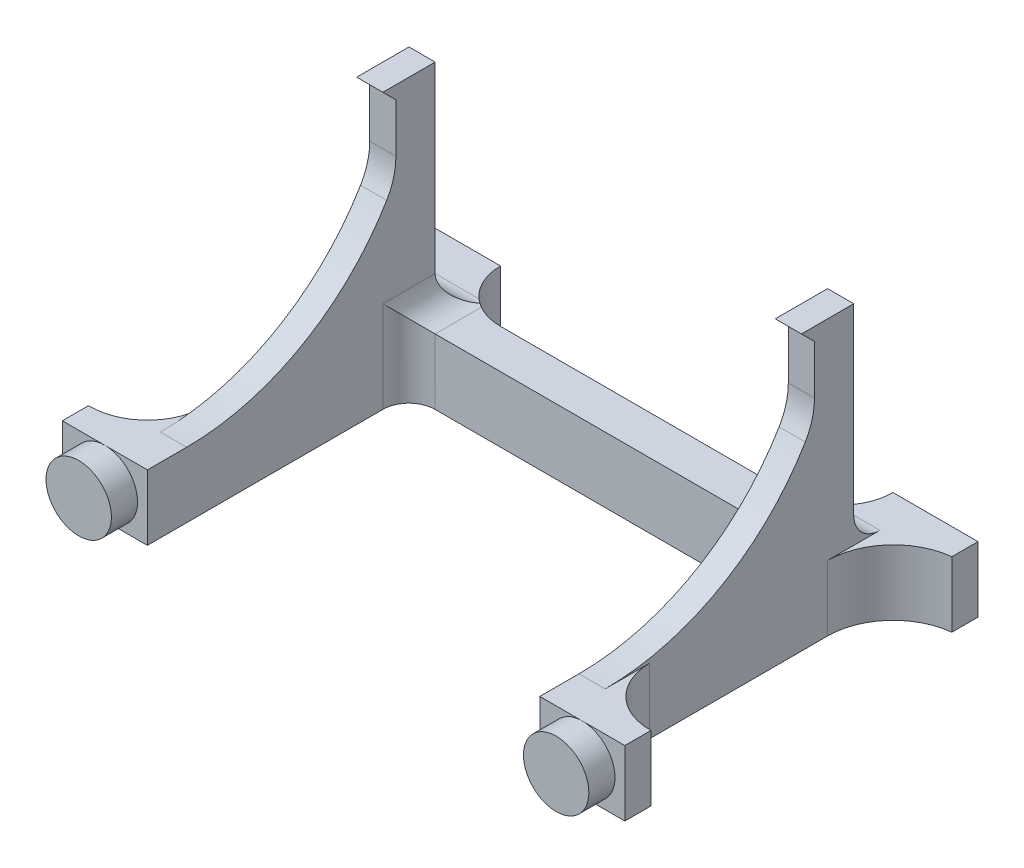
ISO-10303-21;
HEADER;
FILE_DESCRIPTION(('STEP AP214'),'2;1');
FILE_NAME('part.step','',(''),(''),'','','');
FILE_SCHEMA(('AUTOMOTIVE_DESIGN { 1 0 10303 214 1 1 1 1 }'));
ENDSEC;
DATA;
#1=APPLICATION_CONTEXT('core data for automotive mechanical design processes');
#2=APPLICATION_PROTOCOL_DEFINITION('international standard','automotive_design',2000,#1);
#3=PRODUCT_CONTEXT('',#1,'mechanical');
#4=PRODUCT('Part','Part','',(#3));
#5=PRODUCT_RELATED_PRODUCT_CATEGORY('part','',(#4));
#6=PRODUCT_DEFINITION_FORMATION('','',#4);
#7=PRODUCT_DEFINITION_CONTEXT('part definition',#1,'design');
#8=PRODUCT_DEFINITION('design','',#6,#7);
#9=PRODUCT_DEFINITION_SHAPE('','',#8);
#10=(LENGTH_UNIT() NAMED_UNIT(*) SI_UNIT(.MILLI.,.METRE.));
#11=(NAMED_UNIT(*) PLANE_ANGLE_UNIT() SI_UNIT($,.RADIAN.));
#12=(NAMED_UNIT(*) SI_UNIT($,.STERADIAN.) SOLID_ANGLE_UNIT());
#13=UNCERTAINTY_MEASURE_WITH_UNIT(LENGTH_MEASURE(1.E-05),#10,'distance_accuracy_value','');
#14=(GEOMETRIC_REPRESENTATION_CONTEXT(3) GLOBAL_UNCERTAINTY_ASSIGNED_CONTEXT((#13)) GLOBAL_UNIT_ASSIGNED_CONTEXT((#10,
#11,#12)) REPRESENTATION_CONTEXT('',''));
#15=CARTESIAN_POINT('',(0.,0.,0.));
#16=DIRECTION('',(0.,0.,1.));
#17=DIRECTION('',(1.,0.,0.));
#18=AXIS2_PLACEMENT_3D('',#15,#16,#17);
#19=CARTESIAN_POINT('',(0.,2.5,0.));
#20=DIRECTION('',(0.,1.,0.));
#21=DIRECTION('',(0.,0.,1.));
#22=AXIS2_PLACEMENT_3D('',#19,#20,#21);
#23=PLANE('',#22);
#24=DIRECTION('',(0.,0.,-1.));
#25=VECTOR('',#24,1.);
#26=CARTESIAN_POINT('',(-17.,2.5,-11.9999999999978));
#27=LINE('',#26,#25);
#28=CARTESIAN_POINT('',(-17.0000000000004,2.5,-9.99999999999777));
#29=VERTEX_POINT('',#28);
#30=CARTESIAN_POINT('',(-17.,2.5,-13.9999999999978));
#31=VERTEX_POINT('',#30);
#32=EDGE_CURVE('E365',#29,#31,#27,.T.);
#33=ORIENTED_EDGE('',*,*,#32,.T.);
#34=DIRECTION('',(1.,0.,0.));
#35=VECTOR('',#34,1.);
#36=CARTESIAN_POINT('',(-15.,2.5,-13.9999999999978));
#37=LINE('',#36,#35);
#38=CARTESIAN_POINT('',(-13.6457513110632,2.5,-13.9999999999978));
#39=VERTEX_POINT('',#38);
#40=EDGE_CURVE('E625',#31,#39,#37,.T.);
#41=ORIENTED_EDGE('',*,*,#40,.T.);
#42=CARTESIAN_POINT('',(-10.9999999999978,2.5,-17.));
#43=DIRECTION('',(0.,-1.,0.));
#44=DIRECTION('',(0.,0.,1.));
#45=AXIS2_PLACEMENT_3D('',#42,#43,#44);
#46=CIRCLE('',#45,4.00000000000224);
#47=CARTESIAN_POINT('',(-15.,2.5,-17.));
#48=VERTEX_POINT('',#47);
#49=EDGE_CURVE('E434',#48,#39,#46,.F.);
#50=ORIENTED_EDGE('',*,*,#49,.F.);
#51=DIRECTION('',(1.,0.,0.));
#52=VECTOR('',#51,1.);
#53=CARTESIAN_POINT('',(0.,2.5,-17.));
#54=LINE('',#53,#52);
#55=CARTESIAN_POINT('',(-21.5000000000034,2.5,-17.));
#56=VERTEX_POINT('',#55);
#57=EDGE_CURVE('E436',#56,#48,#54,.T.);
#58=ORIENTED_EDGE('',*,*,#57,.F.);
#59=DIRECTION('',(0.,0.,1.));
#60=VECTOR('',#59,1.);
#61=CARTESIAN_POINT('',(-21.5000000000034,2.5,0.));
#62=LINE('',#61,#60);
#63=CARTESIAN_POINT('',(-21.5000000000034,2.5,-15.));
#64=VERTEX_POINT('',#63);
#65=EDGE_CURVE('E439',#56,#64,#62,.T.);
#66=ORIENTED_EDGE('',*,*,#65,.T.);
#67=CARTESIAN_POINT('',(-22.0277777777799,2.5,-9.99999999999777));
#68=DIRECTION('',(0.,-1.,0.));
#69=DIRECTION('',(0.,0.,1.));
#70=AXIS2_PLACEMENT_3D('',#67,#68,#69);
#71=CIRCLE('',#70,5.02777777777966);
#72=EDGE_CURVE('E441',#29,#64,#71,.F.);
#73=ORIENTED_EDGE('',*,*,#72,.F.);
#74=EDGE_LOOP('',(#33,#41,#50,#58,#66,#73));
#75=FACE_BOUND('',#74,.T.);
#76=ADVANCED_FACE('F40',(#75),#23,.T.);
#77=CARTESIAN_POINT('',(-12.9999999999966,2.5,-13.535898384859));
#78=VERTEX_POINT('',#77);
#79=CARTESIAN_POINT('',(-10.9999999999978,2.5,-12.9999999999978));
#80=VERTEX_POINT('',#79);
#81=EDGE_CURVE('E433',#78,#80,#46,.F.);
#82=ORIENTED_EDGE('',*,*,#81,.F.);
#83=DIRECTION('',(0.,0.,-1.));
#84=VECTOR('',#83,1.);
#85=CARTESIAN_POINT('',(-12.9999999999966,2.5,0.));
#86=LINE('',#85,#84);
#87=CARTESIAN_POINT('',(-12.9999999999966,2.5,-9.99999999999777));
#88=VERTEX_POINT('',#87);
#89=EDGE_CURVE('E623',#78,#88,#86,.F.);
#90=ORIENTED_EDGE('',*,*,#89,.T.);
#91=DIRECTION('',(1.,0.,0.));
#92=VECTOR('',#91,1.);
#93=CARTESIAN_POINT('',(0.,2.5,-9.99999999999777));
#94=LINE('',#93,#92);
#95=CARTESIAN_POINT('',(12.9999999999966,2.5,-9.99999999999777));
#96=VERTEX_POINT('',#95);
#97=EDGE_CURVE('E562',#88,#96,#94,.T.);
#98=ORIENTED_EDGE('',*,*,#97,.T.);
#99=DIRECTION('',(0.,0.,1.));
#100=VECTOR('',#99,1.);
#101=CARTESIAN_POINT('',(12.9999999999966,2.5,-11.9999999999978));
#102=LINE('',#101,#100);
#103=CARTESIAN_POINT('',(12.9999999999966,2.5,-13.535898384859));
#104=VERTEX_POINT('',#103);
#105=EDGE_CURVE('E621',#96,#104,#102,.F.);
#106=ORIENTED_EDGE('',*,*,#105,.T.);
#107=CARTESIAN_POINT('',(10.9999999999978,2.5,-17.));
#108=DIRECTION('',(0.,1.,0.));
#109=DIRECTION('',(0.,0.,1.));
#110=AXIS2_PLACEMENT_3D('',#107,#108,#109);
#111=CIRCLE('',#110,4.00000000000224);
#112=CARTESIAN_POINT('',(10.9999999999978,2.5,-12.9999999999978));
#113=VERTEX_POINT('',#112);
#114=EDGE_CURVE('E555',#104,#113,#111,.F.);
#115=ORIENTED_EDGE('',*,*,#114,.T.);
#116=DIRECTION('',(1.,0.,0.));
#117=VECTOR('',#116,1.);
#118=CARTESIAN_POINT('',(0.,2.5,-12.9999999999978));
#119=LINE('',#118,#117);
#120=EDGE_CURVE('E559',#80,#113,#119,.T.);
#121=ORIENTED_EDGE('',*,*,#120,.F.);
#122=EDGE_LOOP('',(#82,#90,#98,#106,#115,#121));
#123=FACE_BOUND('',#122,.T.);
#124=ADVANCED_FACE('F742',(#123),#23,.T.);
#125=CARTESIAN_POINT('',(15.,2.5,-17.));
#126=VERTEX_POINT('',#125);
#127=CARTESIAN_POINT('',(13.6457513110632,2.5,-13.9999999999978));
#128=VERTEX_POINT('',#127);
#129=EDGE_CURVE('E556',#126,#128,#111,.F.);
#130=ORIENTED_EDGE('',*,*,#129,.T.);
#131=DIRECTION('',(-1.,0.,0.));
#132=VECTOR('',#131,1.);
#133=CARTESIAN_POINT('',(0.,2.5,-13.9999999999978));
#134=LINE('',#133,#132);
#135=CARTESIAN_POINT('',(17.,2.5,-13.9999999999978));
#136=VERTEX_POINT('',#135);
#137=EDGE_CURVE('E618',#128,#136,#134,.F.);
#138=ORIENTED_EDGE('',*,*,#137,.T.);
#139=DIRECTION('',(0.,0.,1.));
#140=VECTOR('',#139,1.);
#141=CARTESIAN_POINT('',(17.,2.5,0.));
#142=LINE('',#141,#140);
#143=CARTESIAN_POINT('',(17.,2.5,-9.99999999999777));
#144=VERTEX_POINT('',#143);
#145=EDGE_CURVE('E613',#136,#144,#142,.T.);
#146=ORIENTED_EDGE('',*,*,#145,.T.);
#147=CARTESIAN_POINT('',(22.0277777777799,2.5,-9.99999999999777));
#148=DIRECTION('',(0.,1.,0.));
#149=DIRECTION('',(0.,0.,1.));
#150=AXIS2_PLACEMENT_3D('',#147,#148,#149);
#151=CIRCLE('',#150,5.02777777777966);
#152=CARTESIAN_POINT('',(21.5000000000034,2.5,-15.));
#153=VERTEX_POINT('',#152);
#154=EDGE_CURVE('E547',#144,#153,#151,.F.);
#155=ORIENTED_EDGE('',*,*,#154,.T.);
#156=DIRECTION('',(0.,0.,1.));
#157=VECTOR('',#156,1.);
#158=CARTESIAN_POINT('',(21.5000000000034,2.5,0.));
#159=LINE('',#158,#157);
#160=CARTESIAN_POINT('',(21.5000000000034,2.5,-17.));
#161=VERTEX_POINT('',#160);
#162=EDGE_CURVE('E550',#161,#153,#159,.T.);
#163=ORIENTED_EDGE('',*,*,#162,.F.);
#164=DIRECTION('',(-1.,0.,0.));
#165=VECTOR('',#164,1.);
#166=CARTESIAN_POINT('',(0.,2.5,-17.));
#167=LINE('',#166,#165);
#168=EDGE_CURVE('E553',#161,#126,#167,.T.);
#169=ORIENTED_EDGE('',*,*,#168,.T.);
#170=EDGE_LOOP('',(#130,#138,#146,#155,#163,#169));
#171=FACE_BOUND('',#170,.T.);
#172=ADVANCED_FACE('F749',(#171),#23,.T.);
#173=CARTESIAN_POINT('',(0.,-2.5,0.));
#174=DIRECTION('',(0.,1.,0.));
#175=DIRECTION('',(0.,0.,1.));
#176=AXIS2_PLACEMENT_3D('',#173,#174,#175);
#177=PLANE('',#176);
#178=DIRECTION('',(0.,0.,1.));
#179=VECTOR('',#178,1.);
#180=CARTESIAN_POINT('',(21.5000000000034,-2.5,0.));
#181=LINE('',#180,#179);
#182=CARTESIAN_POINT('',(21.5000000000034,-2.5,-17.));
#183=VERTEX_POINT('',#182);
#184=CARTESIAN_POINT('',(21.5000000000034,-2.5,-15.));
#185=VERTEX_POINT('',#184);
#186=EDGE_CURVE('E578',#183,#185,#181,.T.);
#187=ORIENTED_EDGE('',*,*,#186,.T.);
#188=CARTESIAN_POINT('',(22.0277777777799,-2.5,-9.99999999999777));
#189=DIRECTION('',(0.,1.,0.));
#190=DIRECTION('',(0.,0.,1.));
#191=AXIS2_PLACEMENT_3D('',#188,#189,#190);
#192=CIRCLE('',#191,5.02777777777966);
#193=CARTESIAN_POINT('',(17.0000000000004,-2.5,-9.99999999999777));
#194=VERTEX_POINT('',#193);
#195=EDGE_CURVE('E576',#194,#185,#192,.F.);
#196=ORIENTED_EDGE('',*,*,#195,.F.);
#197=DIRECTION('',(1.68370219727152E-13,0.,1.));
#198=VECTOR('',#197,1.);
#199=CARTESIAN_POINT('',(17.0000000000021,-2.5,-2.86229373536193E-12));
#200=LINE('',#199,#198);
#201=CARTESIAN_POINT('',(17.0000000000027,-2.5,3.60000000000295));
#202=VERTEX_POINT('',#201);
#203=EDGE_CURVE('E334',#194,#202,#200,.T.);
#204=ORIENTED_EDGE('',*,*,#203,.T.);
#205=CARTESIAN_POINT('',(21.4000000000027,-2.5,3.60000000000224));
#206=DIRECTION('',(0.,1.,0.));
#207=DIRECTION('',(0.,0.,1.));
#208=AXIS2_PLACEMENT_3D('',#205,#206,#207);
#209=CIRCLE('',#208,4.4);
#210=CARTESIAN_POINT('',(21.4000000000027,-2.5,8.00000000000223));
#211=VERTEX_POINT('',#210);
#212=EDGE_CURVE('E325',#202,#211,#209,.T.);
#213=ORIENTED_EDGE('',*,*,#212,.T.);
#214=DIRECTION('',(1.,0.,0.));
#215=VECTOR('',#214,1.);
#216=CARTESIAN_POINT('',(0.,-2.5,8.00000000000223));
#217=LINE('',#216,#215);
#218=CARTESIAN_POINT('',(21.5000000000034,-2.5,8.00000000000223));
#219=VERTEX_POINT('',#218);
#220=EDGE_CURVE('E330',#211,#219,#217,.T.);
#221=ORIENTED_EDGE('',*,*,#220,.T.);
#222=DIRECTION('',(0.,0.,1.));
#223=VECTOR('',#222,1.);
#224=CARTESIAN_POINT('',(21.5000000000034,-2.5,0.));
#225=LINE('',#224,#223);
#226=CARTESIAN_POINT('',(21.5000000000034,-2.5,10.0000000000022));
#227=VERTEX_POINT('',#226);
#228=EDGE_CURVE('E548',#219,#227,#225,.T.);
#229=ORIENTED_EDGE('',*,*,#228,.T.);
#230=DIRECTION('',(1.,0.,0.));
#231=VECTOR('',#230,1.);
#232=CARTESIAN_POINT('',(0.,-2.5,10.0000000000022));
#233=LINE('',#232,#231);
#234=CARTESIAN_POINT('',(18.25,-2.5,10.0000000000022));
#235=VERTEX_POINT('',#234);
#236=EDGE_CURVE('E593',#235,#227,#233,.T.);
#237=ORIENTED_EDGE('',*,*,#236,.F.);
#238=CARTESIAN_POINT('',(14.9999999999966,-2.5,10.0000000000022));
#239=VERTEX_POINT('',#238);
#240=EDGE_CURVE('E594',#239,#235,#233,.T.);
#241=ORIENTED_EDGE('',*,*,#240,.F.);
#242=DIRECTION('',(0.,0.,-1.));
#243=VECTOR('',#242,1.);
#244=CARTESIAN_POINT('',(14.9999999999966,-2.5,0.));
#245=LINE('',#244,#243);
#246=CARTESIAN_POINT('',(14.9999999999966,-2.5,-7.99999999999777));
#247=VERTEX_POINT('',#246);
#248=EDGE_CURVE('E590',#239,#247,#245,.T.);
#249=ORIENTED_EDGE('',*,*,#248,.T.);
#250=CARTESIAN_POINT('',(12.9999999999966,-2.5,-7.99999999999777));
#251=DIRECTION('',(0.,1.,0.));
#252=DIRECTION('',(0.,0.,1.));
#253=AXIS2_PLACEMENT_3D('',#250,#251,#252);
#254=CIRCLE('',#253,2.);
#255=CARTESIAN_POINT('',(12.9999999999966,-2.5,-9.99999999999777));
#256=VERTEX_POINT('',#255);
#257=EDGE_CURVE('E700',#247,#256,#254,.T.);
#258=ORIENTED_EDGE('',*,*,#257,.T.);
#259=DIRECTION('',(1.,0.,0.));
#260=VECTOR('',#259,1.);
#261=CARTESIAN_POINT('',(0.,-2.5,-9.99999999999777));
#262=LINE('',#261,#260);
#263=CARTESIAN_POINT('',(-12.9999999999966,-2.5,-9.99999999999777));
#264=VERTEX_POINT('',#263);
#265=EDGE_CURVE('E587',#264,#256,#262,.T.);
#266=ORIENTED_EDGE('',*,*,#265,.F.);
#267=CARTESIAN_POINT('',(-12.9999999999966,-2.5,-7.99999999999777));
#268=DIRECTION('',(0.,1.,0.));
#269=DIRECTION('',(0.,0.,1.));
#270=AXIS2_PLACEMENT_3D('',#267,#268,#269);
#271=CIRCLE('',#270,2.);
#272=CARTESIAN_POINT('',(-14.9999999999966,-2.5,-7.99999999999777));
#273=VERTEX_POINT('',#272);
#274=EDGE_CURVE('E675',#264,#273,#271,.T.);
#275=ORIENTED_EDGE('',*,*,#274,.T.);
#276=DIRECTION('',(0.,0.,-1.));
#277=VECTOR('',#276,1.);
#278=CARTESIAN_POINT('',(-14.9999999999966,-2.5,0.));
#279=LINE('',#278,#277);
#280=CARTESIAN_POINT('',(-14.9999999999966,-2.5,10.0000000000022));
#281=VERTEX_POINT('',#280);
#282=EDGE_CURVE('E456',#281,#273,#279,.T.);
#283=ORIENTED_EDGE('',*,*,#282,.F.);
#284=DIRECTION('',(-1.,0.,0.));
#285=VECTOR('',#284,1.);
#286=CARTESIAN_POINT('',(0.,-2.5,10.0000000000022));
#287=LINE('',#286,#285);
#288=CARTESIAN_POINT('',(-18.25,-2.5,10.0000000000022));
#289=VERTEX_POINT('',#288);
#290=EDGE_CURVE('E453',#281,#289,#287,.T.);
#291=ORIENTED_EDGE('',*,*,#290,.T.);
#292=CARTESIAN_POINT('',(-21.5000000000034,-2.5,10.0000000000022));
#293=VERTEX_POINT('',#292);
#294=EDGE_CURVE('E452',#289,#293,#287,.T.);
#295=ORIENTED_EDGE('',*,*,#294,.T.);
#296=DIRECTION('',(0.,0.,1.));
#297=VECTOR('',#296,1.);
#298=CARTESIAN_POINT('',(-21.5000000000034,-2.5,0.));
#299=LINE('',#298,#297);
#300=CARTESIAN_POINT('',(-21.5000000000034,-2.5,8.00000000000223));
#301=VERTEX_POINT('',#300);
#302=EDGE_CURVE('E449',#301,#293,#299,.T.);
#303=ORIENTED_EDGE('',*,*,#302,.F.);
#304=DIRECTION('',(-1.,0.,0.));
#305=VECTOR('',#304,1.);
#306=CARTESIAN_POINT('',(0.,-2.5,8.00000000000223));
#307=LINE('',#306,#305);
#308=CARTESIAN_POINT('',(-21.4000000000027,-2.5,8.00000000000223));
#309=VERTEX_POINT('',#308);
#310=EDGE_CURVE('E447',#309,#301,#307,.T.);
#311=ORIENTED_EDGE('',*,*,#310,.F.);
#312=CARTESIAN_POINT('',(-21.4000000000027,-2.5,3.60000000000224));
#313=DIRECTION('',(0.,-1.,0.));
#314=DIRECTION('',(0.,0.,1.));
#315=AXIS2_PLACEMENT_3D('',#312,#313,#314);
#316=CIRCLE('',#315,4.4);
#317=CARTESIAN_POINT('',(-17.0000000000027,-2.5,3.60000000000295));
#318=VERTEX_POINT('',#317);
#319=EDGE_CURVE('E417',#318,#309,#316,.T.);
#320=ORIENTED_EDGE('',*,*,#319,.F.);
#321=DIRECTION('',(-1.68370219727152E-13,0.,1.));
#322=VECTOR('',#321,1.);
#323=CARTESIAN_POINT('',(-17.0000000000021,-2.5,-2.86229373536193E-12));
#324=LINE('',#323,#322);
#325=CARTESIAN_POINT('',(-17.0000000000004,-2.5,-9.99999999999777));
#326=VERTEX_POINT('',#325);
#327=EDGE_CURVE('E423',#326,#318,#324,.T.);
#328=ORIENTED_EDGE('',*,*,#327,.F.);
#329=CARTESIAN_POINT('',(-22.0277777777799,-2.5,-9.99999999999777));
#330=DIRECTION('',(0.,-1.,0.));
#331=DIRECTION('',(0.,0.,1.));
#332=AXIS2_PLACEMENT_3D('',#329,#330,#331);
#333=CIRCLE('',#332,5.02777777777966);
#334=CARTESIAN_POINT('',(-21.5000000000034,-2.5,-15.));
#335=VERTEX_POINT('',#334);
#336=EDGE_CURVE('E468',#326,#335,#333,.F.);
#337=ORIENTED_EDGE('',*,*,#336,.T.);
#338=DIRECTION('',(0.,0.,1.));
#339=VECTOR('',#338,1.);
#340=CARTESIAN_POINT('',(-21.5000000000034,-2.5,0.));
#341=LINE('',#340,#339);
#342=CARTESIAN_POINT('',(-21.5000000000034,-2.5,-17.));
#343=VERTEX_POINT('',#342);
#344=EDGE_CURVE('E465',#343,#335,#341,.T.);
#345=ORIENTED_EDGE('',*,*,#344,.F.);
#346=DIRECTION('',(1.,0.,0.));
#347=VECTOR('',#346,1.);
#348=CARTESIAN_POINT('',(0.,-2.5,-17.));
#349=LINE('',#348,#347);
#350=CARTESIAN_POINT('',(-15.,-2.5,-17.));
#351=VERTEX_POINT('',#350);
#352=EDGE_CURVE('E462',#343,#351,#349,.T.);
#353=ORIENTED_EDGE('',*,*,#352,.T.);
#354=CARTESIAN_POINT('',(-10.9999999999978,-2.5,-17.));
#355=DIRECTION('',(0.,-1.,0.));
#356=DIRECTION('',(0.,0.,1.));
#357=AXIS2_PLACEMENT_3D('',#354,#355,#356);
#358=CIRCLE('',#357,4.00000000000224);
#359=CARTESIAN_POINT('',(-10.9999999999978,-2.5,-12.9999999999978));
#360=VERTEX_POINT('',#359);
#361=EDGE_CURVE('E459',#351,#360,#358,.F.);
#362=ORIENTED_EDGE('',*,*,#361,.T.);
#363=DIRECTION('',(1.,0.,0.));
#364=VECTOR('',#363,1.);
#365=CARTESIAN_POINT('',(0.,-2.5,-12.9999999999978));
#366=LINE('',#365,#364);
#367=CARTESIAN_POINT('',(10.9999999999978,-2.5,-12.9999999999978));
#368=VERTEX_POINT('',#367);
#369=EDGE_CURVE('E585',#360,#368,#366,.T.);
#370=ORIENTED_EDGE('',*,*,#369,.T.);
#371=CARTESIAN_POINT('',(10.9999999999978,-2.5,-17.));
#372=DIRECTION('',(0.,1.,0.));
#373=DIRECTION('',(0.,0.,1.));
#374=AXIS2_PLACEMENT_3D('',#371,#372,#373);
#375=CIRCLE('',#374,4.00000000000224);
#376=CARTESIAN_POINT('',(15.,-2.5,-17.));
#377=VERTEX_POINT('',#376);
#378=EDGE_CURVE('E582',#377,#368,#375,.F.);
#379=ORIENTED_EDGE('',*,*,#378,.F.);
#380=DIRECTION('',(-1.,0.,0.));
#381=VECTOR('',#380,1.);
#382=CARTESIAN_POINT('',(0.,-2.5,-17.));
#383=LINE('',#382,#381);
#384=EDGE_CURVE('E580',#183,#377,#383,.T.);
#385=ORIENTED_EDGE('',*,*,#384,.F.);
#386=EDGE_LOOP('',(#187,#196,#204,#213,#221,#229,#237,#241,#249,#258,#266,#275,#283,#291,#295,
#303,#311,#320,#328,#337,#345,#353,#362,#370,#379,#385));
#387=FACE_BOUND('',#386,.T.);
#388=ADVANCED_FACE('F328',(#387),#177,.F.);
#389=CARTESIAN_POINT('',(21.5000000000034,2.5,0.));
#390=DIRECTION('',(1.,0.,0.));
#391=DIRECTION('',(0.,0.,-1.));
#392=AXIS2_PLACEMENT_3D('',#389,#390,#391);
#393=PLANE('',#392);
#394=ORIENTED_EDGE('',*,*,#162,.T.);
#395=DIRECTION('',(0.,1.,0.));
#396=VECTOR('',#395,1.);
#397=CARTESIAN_POINT('',(21.5000000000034,-2.5,-15.));
#398=LINE('',#397,#396);
#399=EDGE_CURVE('E356',#185,#153,#398,.T.);
#400=ORIENTED_EDGE('',*,*,#399,.F.);
#401=ORIENTED_EDGE('',*,*,#186,.F.);
#402=DIRECTION('',(0.,-1.,0.));
#403=VECTOR('',#402,1.);
#404=CARTESIAN_POINT('',(21.5000000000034,2.5,-17.));
#405=LINE('',#404,#403);
#406=EDGE_CURVE('E607',#161,#183,#405,.T.);
#407=ORIENTED_EDGE('',*,*,#406,.F.);
#408=EDGE_LOOP('',(#394,#400,#401,#407));
#409=FACE_BOUND('',#408,.T.);
#410=ADVANCED_FACE('F719',(#409),#393,.T.);
#411=DIRECTION('',(0.,0.,-1.));
#412=VECTOR('',#411,1.);
#413=CARTESIAN_POINT('',(-14.9999999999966,2.5,0.));
#414=LINE('',#413,#412);
#415=CARTESIAN_POINT('',(-14.9999999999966,2.5,10.0000000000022));
#416=VERTEX_POINT('',#415);
#417=CARTESIAN_POINT('',(-14.9999999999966,2.5,7.00000000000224));
#418=VERTEX_POINT('',#417);
#419=EDGE_CURVE('E431',#416,#418,#414,.T.);
#420=ORIENTED_EDGE('',*,*,#419,.T.);
#421=DIRECTION('',(1.,0.,0.));
#422=VECTOR('',#421,1.);
#423=CARTESIAN_POINT('',(-17.,2.5,7.00000000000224));
#424=LINE('',#423,#422);
#425=CARTESIAN_POINT('',(-17.,2.5,7.00000000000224));
#426=VERTEX_POINT('',#425);
#427=EDGE_CURVE('E410',#426,#418,#424,.T.);
#428=ORIENTED_EDGE('',*,*,#427,.F.);
#429=CARTESIAN_POINT('',(-17.0000000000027,2.5,3.60000000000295));
#430=VERTEX_POINT('',#429);
#431=EDGE_CURVE('E367',#426,#430,#27,.T.);
#432=ORIENTED_EDGE('',*,*,#431,.T.);
#433=CARTESIAN_POINT('',(-21.4000000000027,2.5,3.60000000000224));
#434=DIRECTION('',(0.,-1.,0.));
#435=DIRECTION('',(0.,0.,1.));
#436=AXIS2_PLACEMENT_3D('',#433,#434,#435);
#437=CIRCLE('',#436,4.4);
#438=CARTESIAN_POINT('',(-21.4000000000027,2.5,8.00000000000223));
#439=VERTEX_POINT('',#438);
#440=EDGE_CURVE('E419',#430,#439,#437,.T.);
#441=ORIENTED_EDGE('',*,*,#440,.T.);
#442=DIRECTION('',(-1.,0.,0.));
#443=VECTOR('',#442,1.);
#444=CARTESIAN_POINT('',(0.,2.5,8.00000000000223));
#445=LINE('',#444,#443);
#446=CARTESIAN_POINT('',(-21.5000000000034,2.5,8.00000000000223));
#447=VERTEX_POINT('',#446);
#448=EDGE_CURVE('E422',#439,#447,#445,.T.);
#449=ORIENTED_EDGE('',*,*,#448,.T.);
#450=DIRECTION('',(0.,0.,1.));
#451=VECTOR('',#450,1.);
#452=CARTESIAN_POINT('',(-21.5000000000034,2.5,0.));
#453=LINE('',#452,#451);
#454=CARTESIAN_POINT('',(-21.5000000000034,2.5,10.0000000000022));
#455=VERTEX_POINT('',#454);
#456=EDGE_CURVE('E425',#447,#455,#453,.T.);
#457=ORIENTED_EDGE('',*,*,#456,.T.);
#458=DIRECTION('',(-1.,0.,0.));
#459=VECTOR('',#458,1.);
#460=CARTESIAN_POINT('',(0.,2.5,10.0000000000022));
#461=LINE('',#460,#459);
#462=CARTESIAN_POINT('',(-18.25,2.5,10.0000000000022));
#463=VERTEX_POINT('',#462);
#464=EDGE_CURVE('E428',#463,#455,#461,.T.);
#465=ORIENTED_EDGE('',*,*,#464,.F.);
#466=EDGE_CURVE('E429',#416,#463,#461,.T.);
#467=ORIENTED_EDGE('',*,*,#466,.F.);
#468=EDGE_LOOP('',(#420,#428,#432,#441,#449,#457,#465,#467));
#469=FACE_BOUND('',#468,.T.);
#470=ADVANCED_FACE('F722',(#469),#23,.T.);
#471=CARTESIAN_POINT('',(0.,2.5,10.0000000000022));
#472=DIRECTION('',(0.,0.,1.));
#473=DIRECTION('',(1.,0.,0.));
#474=AXIS2_PLACEMENT_3D('',#471,#472,#473);
#475=PLANE('',#474);
#476=CARTESIAN_POINT('',(-18.25,0.,10.0000000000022));
#477=DIRECTION('',(0.,0.,1.));
#478=DIRECTION('',(1.,0.,0.));
#479=AXIS2_PLACEMENT_3D('',#476,#477,#478);
#480=CIRCLE('',#479,2.5);
#481=EDGE_CURVE('E615',#463,#289,#480,.T.);
#482=ORIENTED_EDGE('',*,*,#481,.F.);
#483=ORIENTED_EDGE('',*,*,#464,.T.);
#484=DIRECTION('',(0.,-1.,0.));
#485=VECTOR('',#484,1.);
#486=CARTESIAN_POINT('',(-21.5000000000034,2.5,10.0000000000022));
#487=LINE('',#486,#485);
#488=EDGE_CURVE('E487',#455,#293,#487,.T.);
#489=ORIENTED_EDGE('',*,*,#488,.T.);
#490=ORIENTED_EDGE('',*,*,#294,.F.);
#491=EDGE_LOOP('',(#482,#483,#489,#490));
#492=FACE_BOUND('',#491,.T.);
#493=ADVANCED_FACE('F732',(#492),#475,.T.);
#494=CARTESIAN_POINT('',(21.4000000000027,2.5,3.60000000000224));
#495=DIRECTION('',(0.,-1.,0.));
#496=DIRECTION('',(0.,0.,-1.));
#497=AXIS2_PLACEMENT_3D('',#494,#495,#496);
#498=CYLINDRICAL_SURFACE('',#497,4.4);
#499=CARTESIAN_POINT('',(21.4000000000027,2.5,3.60000000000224));
#500=DIRECTION('',(0.,1.,0.));
#501=DIRECTION('',(0.,0.,1.));
#502=AXIS2_PLACEMENT_3D('',#499,#500,#501);
#503=CIRCLE('',#502,4.4);
#504=CARTESIAN_POINT('',(17.,2.5,3.60000000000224));
#505=VERTEX_POINT('',#504);
#506=CARTESIAN_POINT('',(21.4000000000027,2.5,8.00000000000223));
#507=VERTEX_POINT('',#506);
#508=EDGE_CURVE('E343',#505,#507,#503,.T.);
#509=ORIENTED_EDGE('',*,*,#508,.T.);
#510=DIRECTION('',(0.,1.,0.));
#511=VECTOR('',#510,1.);
#512=CARTESIAN_POINT('',(21.4000000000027,-2.5,8.00000000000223));
#513=LINE('',#512,#511);
#514=EDGE_CURVE('E340',#211,#507,#513,.T.);
#515=ORIENTED_EDGE('',*,*,#514,.F.);
#516=ORIENTED_EDGE('',*,*,#212,.F.);
#517=DIRECTION('',(0.,-1.,0.));
#518=VECTOR('',#517,1.);
#519=CARTESIAN_POINT('',(17.0000000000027,2.5,3.60000000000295));
#520=LINE('',#519,#518);
#521=EDGE_CURVE('E611',#505,#202,#520,.T.);
#522=ORIENTED_EDGE('',*,*,#521,.F.);
#523=EDGE_LOOP('',(#509,#515,#516,#522));
#524=FACE_BOUND('',#523,.T.);
#525=ADVANCED_FACE('F341',(#524),#498,.F.);
#526=CARTESIAN_POINT('',(0.,2.5,-12.9999999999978));
#527=DIRECTION('',(0.,0.,-1.));
#528=DIRECTION('',(-1.,0.,0.));
#529=AXIS2_PLACEMENT_3D('',#526,#527,#528);
#530=PLANE('',#529);
#531=ORIENTED_EDGE('',*,*,#369,.F.);
#532=DIRECTION('',(0.,-1.,0.));
#533=VECTOR('',#532,1.);
#534=CARTESIAN_POINT('',(-10.9999999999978,2.5,-12.9999999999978));
#535=LINE('',#534,#533);
#536=EDGE_CURVE('E482',#80,#360,#535,.T.);
#537=ORIENTED_EDGE('',*,*,#536,.F.);
#538=ORIENTED_EDGE('',*,*,#120,.T.);
#539=DIRECTION('',(0.,-1.,0.));
#540=VECTOR('',#539,1.);
#541=CARTESIAN_POINT('',(10.9999999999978,2.5,-12.9999999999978));
#542=LINE('',#541,#540);
#543=EDGE_CURVE('E601',#113,#368,#542,.T.);
#544=ORIENTED_EDGE('',*,*,#543,.T.);
#545=EDGE_LOOP('',(#531,#537,#538,#544));
#546=FACE_BOUND('',#545,.T.);
#547=ADVANCED_FACE('F712',(#546),#530,.T.);
#548=CARTESIAN_POINT('',(0.,2.5,-9.99999999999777));
#549=DIRECTION('',(0.,0.,-1.));
#550=DIRECTION('',(-1.,0.,0.));
#551=AXIS2_PLACEMENT_3D('',#548,#549,#550);
#552=PLANE('',#551);
#553=ORIENTED_EDGE('',*,*,#97,.F.);
#554=DIRECTION('',(0.,-1.,0.));
#555=VECTOR('',#554,1.);
#556=CARTESIAN_POINT('',(-12.9999999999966,-2.5,-9.99999999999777));
#557=LINE('',#556,#555);
#558=EDGE_CURVE('E636',#88,#264,#557,.T.);
#559=ORIENTED_EDGE('',*,*,#558,.T.);
#560=ORIENTED_EDGE('',*,*,#265,.T.);
#561=DIRECTION('',(0.,-1.,0.));
#562=VECTOR('',#561,1.);
#563=CARTESIAN_POINT('',(12.9999999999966,2.5,-9.99999999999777));
#564=LINE('',#563,#562);
#565=EDGE_CURVE('E634',#256,#96,#564,.F.);
#566=ORIENTED_EDGE('',*,*,#565,.T.);
#567=EDGE_LOOP('',(#553,#559,#560,#566));
#568=FACE_BOUND('',#567,.T.);
#569=ADVANCED_FACE('F737',(#568),#552,.F.);
#570=DIRECTION('',(1.,0.,0.));
#571=VECTOR('',#570,1.);
#572=CARTESIAN_POINT('',(0.,2.5,8.00000000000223));
#573=LINE('',#572,#571);
#574=CARTESIAN_POINT('',(21.5000000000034,2.5,8.00000000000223));
#575=VERTEX_POINT('',#574);
#576=EDGE_CURVE('E359',#507,#575,#573,.T.);
#577=ORIENTED_EDGE('',*,*,#576,.F.);
#578=ORIENTED_EDGE('',*,*,#508,.F.);
#579=DIRECTION('',(0.,0.,-1.));
#580=VECTOR('',#579,1.);
#581=CARTESIAN_POINT('',(17.,2.5,-11.9999999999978));
#582=LINE('',#581,#580);
#583=CARTESIAN_POINT('',(17.,2.5,7.00000000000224));
#584=VERTEX_POINT('',#583);
#585=EDGE_CURVE('E510',#584,#505,#582,.T.);
#586=ORIENTED_EDGE('',*,*,#585,.F.);
#587=DIRECTION('',(-1.,0.,0.));
#588=VECTOR('',#587,1.);
#589=CARTESIAN_POINT('',(17.,2.5,7.00000000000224));
#590=LINE('',#589,#588);
#591=CARTESIAN_POINT('',(15.,2.5,7.00000000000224));
#592=VERTEX_POINT('',#591);
#593=EDGE_CURVE('E512',#584,#592,#590,.T.);
#594=ORIENTED_EDGE('',*,*,#593,.T.);
#595=DIRECTION('',(0.,0.,-1.));
#596=VECTOR('',#595,1.);
#597=CARTESIAN_POINT('',(14.9999999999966,2.5,0.));
#598=LINE('',#597,#596);
#599=CARTESIAN_POINT('',(14.9999999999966,2.5,10.0000000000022));
#600=VERTEX_POINT('',#599);
#601=EDGE_CURVE('E565',#600,#592,#598,.T.);
#602=ORIENTED_EDGE('',*,*,#601,.F.);
#603=DIRECTION('',(1.,0.,0.));
#604=VECTOR('',#603,1.);
#605=CARTESIAN_POINT('',(0.,2.5,10.0000000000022));
#606=LINE('',#605,#604);
#607=CARTESIAN_POINT('',(18.25,2.5,10.0000000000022));
#608=VERTEX_POINT('',#607);
#609=EDGE_CURVE('E569',#600,#608,#606,.T.);
#610=ORIENTED_EDGE('',*,*,#609,.T.);
#611=CARTESIAN_POINT('',(21.5000000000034,2.5,10.0000000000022));
#612=VERTEX_POINT('',#611);
#613=EDGE_CURVE('E568',#608,#612,#606,.T.);
#614=ORIENTED_EDGE('',*,*,#613,.T.);
#615=DIRECTION('',(0.,0.,1.));
#616=VECTOR('',#615,1.);
#617=CARTESIAN_POINT('',(21.5000000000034,2.5,0.));
#618=LINE('',#617,#616);
#619=EDGE_CURVE('E572',#575,#612,#618,.T.);
#620=ORIENTED_EDGE('',*,*,#619,.F.);
#621=EDGE_LOOP('',(#577,#578,#586,#594,#602,#610,#614,#620));
#622=FACE_BOUND('',#621,.T.);
#623=ADVANCED_FACE('F745',(#622),#23,.T.);
#624=CARTESIAN_POINT('',(0.,2.5,10.0000000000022));
#625=DIRECTION('',(0.,0.,-1.));
#626=DIRECTION('',(-1.,0.,0.));
#627=AXIS2_PLACEMENT_3D('',#624,#625,#626);
#628=PLANE('',#627);
#629=CARTESIAN_POINT('',(18.25,0.,10.0000000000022));
#630=DIRECTION('',(0.,0.,1.));
#631=DIRECTION('',(1.,0.,0.));
#632=AXIS2_PLACEMENT_3D('',#629,#630,#631);
#633=CIRCLE('',#632,2.5);
#634=EDGE_CURVE('E540',#235,#608,#633,.T.);
#635=ORIENTED_EDGE('',*,*,#634,.F.);
#636=ORIENTED_EDGE('',*,*,#236,.T.);
#637=DIRECTION('',(0.,-1.,0.));
#638=VECTOR('',#637,1.);
#639=CARTESIAN_POINT('',(21.5000000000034,2.5,10.0000000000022));
#640=LINE('',#639,#638);
#641=EDGE_CURVE('E573',#612,#227,#640,.T.);
#642=ORIENTED_EDGE('',*,*,#641,.F.);
#643=ORIENTED_EDGE('',*,*,#613,.F.);
#644=EDGE_LOOP('',(#635,#636,#642,#643));
#645=FACE_BOUND('',#644,.T.);
#646=ADVANCED_FACE('F729',(#645),#628,.F.);
#647=CARTESIAN_POINT('',(17.0000000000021,2.5,-2.86229373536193E-12));
#648=DIRECTION('',(1.,0.,-1.68370219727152E-13));
#649=DIRECTION('',(-1.68370219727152E-13,0.,-1.));
#650=AXIS2_PLACEMENT_3D('',#647,#648,#649);
#651=PLANE('',#650);
#652=DIRECTION('',(0.,-1.,0.));
#653=VECTOR('',#652,1.);
#654=CARTESIAN_POINT('',(17.0000000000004,2.5,-9.99999999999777));
#655=LINE('',#654,#653);
#656=EDGE_CURVE('E609',#144,#194,#655,.T.);
#657=ORIENTED_EDGE('',*,*,#656,.F.);
#658=ORIENTED_EDGE('',*,*,#145,.F.);
#659=CARTESIAN_POINT('',(16.9999999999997,4.5,-13.9999999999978));
#660=DIRECTION('',(1.,0.,-1.68370219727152E-13));
#661=DIRECTION('',(-1.68370219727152E-13,0.,-1.));
#662=AXIS2_PLACEMENT_3D('',#659,#660,#661);
#663=CIRCLE('',#662,2.);
#664=CARTESIAN_POINT('',(17.,4.5,-11.9999999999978));
#665=VERTEX_POINT('',#664);
#666=EDGE_CURVE('E11',#136,#665,#663,.F.);
#667=ORIENTED_EDGE('',*,*,#666,.T.);
#668=DIRECTION('',(0.,1.,0.));
#669=VECTOR('',#668,1.);
#670=CARTESIAN_POINT('',(17.,2.5,-11.9999999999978));
#671=LINE('',#670,#669);
#672=CARTESIAN_POINT('',(17.,18.5,-11.9999999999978));
#673=VERTEX_POINT('',#672);
#674=EDGE_CURVE('E497',#665,#673,#671,.T.);
#675=ORIENTED_EDGE('',*,*,#674,.T.);
#676=DIRECTION('',(0.,0.,1.));
#677=VECTOR('',#676,1.);
#678=CARTESIAN_POINT('',(17.,18.5,-11.9999999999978));
#679=LINE('',#678,#677);
#680=CARTESIAN_POINT('',(17.,18.5,-7.9999999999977));
#681=VERTEX_POINT('',#680);
#682=EDGE_CURVE('E499',#673,#681,#679,.T.);
#683=ORIENTED_EDGE('',*,*,#682,.T.);
#684=DIRECTION('',(0.,-0.707106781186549,-0.707106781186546));
#685=VECTOR('',#684,1.);
#686=CARTESIAN_POINT('',(17.,18.5,-7.9999999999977));
#687=LINE('',#686,#685);
#688=CARTESIAN_POINT('',(17.,17.5,-8.99999999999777));
#689=VERTEX_POINT('',#688);
#690=EDGE_CURVE('E502',#681,#689,#687,.T.);
#691=ORIENTED_EDGE('',*,*,#690,.T.);
#692=DIRECTION('',(0.,-1.,0.));
#693=VECTOR('',#692,1.);
#694=CARTESIAN_POINT('',(17.,17.5,-8.99999999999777));
#695=LINE('',#694,#693);
#696=CARTESIAN_POINT('',(17.,13.7547727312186,-8.99999999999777));
#697=VERTEX_POINT('',#696);
#698=EDGE_CURVE('E504',#689,#697,#695,.T.);
#699=ORIENTED_EDGE('',*,*,#698,.T.);
#700=CARTESIAN_POINT('',(17.,13.7547727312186,-3.99999999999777));
#701=DIRECTION('',(-1.,0.,0.));
#702=DIRECTION('',(0.,0.,1.));
#703=AXIS2_PLACEMENT_3D('',#700,#701,#702);
#704=CIRCLE('',#703,5.);
#705=CARTESIAN_POINT('',(17.,11.1980433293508,-8.29687499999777));
#706=VERTEX_POINT('',#705);
#707=EDGE_CURVE('E506',#697,#706,#704,.T.);
#708=ORIENTED_EDGE('',*,*,#707,.T.);
#709=CARTESIAN_POINT('',(17.,20.3,7.00000000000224));
#710=DIRECTION('',(-1.,0.,0.));
#711=DIRECTION('',(0.,0.,-1.));
#712=AXIS2_PLACEMENT_3D('',#709,#710,#711);
#713=CIRCLE('',#712,17.8);
#714=EDGE_CURVE('E508',#706,#584,#713,.T.);
#715=ORIENTED_EDGE('',*,*,#714,.T.);
#716=ORIENTED_EDGE('',*,*,#585,.T.);
#717=ORIENTED_EDGE('',*,*,#521,.T.);
#718=ORIENTED_EDGE('',*,*,#203,.F.);
#719=EDGE_LOOP('',(#657,#658,#667,#675,#683,#691,#699,#708,#715,#716,#717,#718));
#720=FACE_BOUND('',#719,.T.);
#721=ADVANCED_FACE('F726',(#720),#651,.T.);
#722=CARTESIAN_POINT('',(22.0277777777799,2.5,-9.99999999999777));
#723=DIRECTION('',(0.,-1.,0.));
#724=DIRECTION('',(0.,0.,-1.));
#725=AXIS2_PLACEMENT_3D('',#722,#723,#724);
#726=CYLINDRICAL_SURFACE('',#725,5.02777777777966);
#727=ORIENTED_EDGE('',*,*,#399,.T.);
#728=ORIENTED_EDGE('',*,*,#154,.F.);
#729=ORIENTED_EDGE('',*,*,#656,.T.);
#730=ORIENTED_EDGE('',*,*,#195,.T.);
#731=EDGE_LOOP('',(#727,#728,#729,#730));
#732=FACE_BOUND('',#731,.T.);
#733=ADVANCED_FACE('F717',(#732),#726,.F.);
#734=CARTESIAN_POINT('',(0.,2.5,-17.));
#735=DIRECTION('',(0.,0.,1.));
#736=DIRECTION('',(1.,0.,0.));
#737=AXIS2_PLACEMENT_3D('',#734,#735,#736);
#738=PLANE('',#737);
#739=ORIENTED_EDGE('',*,*,#384,.T.);
#740=DIRECTION('',(0.,-1.,0.));
#741=VECTOR('',#740,1.);
#742=CARTESIAN_POINT('',(15.,2.5,-17.));
#743=LINE('',#742,#741);
#744=EDGE_CURVE('E604',#126,#377,#743,.T.);
#745=ORIENTED_EDGE('',*,*,#744,.F.);
#746=ORIENTED_EDGE('',*,*,#168,.F.);
#747=ORIENTED_EDGE('',*,*,#406,.T.);
#748=EDGE_LOOP('',(#739,#745,#746,#747));
#749=FACE_BOUND('',#748,.T.);
#750=ADVANCED_FACE('F711',(#749),#738,.F.);
#751=CARTESIAN_POINT('',(10.9999999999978,2.5,-17.));
#752=DIRECTION('',(0.,-1.,0.));
#753=DIRECTION('',(0.,0.,-1.));
#754=AXIS2_PLACEMENT_3D('',#751,#752,#753);
#755=CYLINDRICAL_SURFACE('',#754,4.00000000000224);
#756=ORIENTED_EDGE('',*,*,#378,.T.);
#757=ORIENTED_EDGE('',*,*,#543,.F.);
#758=ORIENTED_EDGE('',*,*,#114,.F.);
#759=CARTESIAN_POINT('',(12.9999999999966,2.5,-13.535898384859));
#760=CARTESIAN_POINT('',(13.0243490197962,2.49999986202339,-13.5499558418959));
#761=CARTESIAN_POINT('',(13.0485484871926,2.5004446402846,-13.5642701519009));
#762=CARTESIAN_POINT('',(13.0965868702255,2.50218926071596,-13.5933725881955));
#763=CARTESIAN_POINT('',(13.1204262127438,2.50348799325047,-13.6081600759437));
#764=CARTESIAN_POINT('',(13.1677457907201,2.50690589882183,-13.638205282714));
#765=CARTESIAN_POINT('',(13.1912260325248,2.50902505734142,-13.6534629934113));
#766=CARTESIAN_POINT('',(13.2378334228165,2.5140530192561,-13.6844478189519));
#767=CARTESIAN_POINT('',(13.2609600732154,2.51696284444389,-13.7001755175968));
#768=CARTESIAN_POINT('',(13.2838821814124,2.5202497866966,-13.716117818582));
#769=B_SPLINE_CURVE_WITH_KNOTS('',3,(#759,#760,#761,#762,#763,#764,#765,#766,#767,#768),
.UNSPECIFIED.,.F.,.F.,(4,2,2,2,4),(0.,0.0843401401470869,0.168570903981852,0.252800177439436,
0.33713882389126),.UNSPECIFIED.);
#770=CARTESIAN_POINT('',(13.2838821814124,2.5202497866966,-13.716117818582));
#771=VERTEX_POINT('',#770);
#772=EDGE_CURVE('E58',#104,#771,#769,.T.);
#773=ORIENTED_EDGE('',*,*,#772,.T.);
#774=CARTESIAN_POINT('',(13.2838821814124,2.52024978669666,-13.716117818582));
#775=CARTESIAN_POINT('',(13.3153180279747,2.51711512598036,-13.73798055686));
#776=CARTESIAN_POINT('',(13.3464612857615,2.51428252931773,-13.7603102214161));
#777=CARTESIAN_POINT('',(13.4080903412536,2.50931372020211,-13.8058543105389));
#778=CARTESIAN_POINT('',(13.438576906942,2.5071766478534,-13.8290676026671));
#779=CARTESIAN_POINT('',(13.498899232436,2.50368287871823,-13.8763848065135));
#780=CARTESIAN_POINT('',(13.5287349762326,2.50232620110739,-13.9004887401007));
#781=CARTESIAN_POINT('',(13.5877531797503,2.50048438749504,-13.9495885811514));
#782=CARTESIAN_POINT('',(13.6169347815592,2.50000033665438,-13.9745855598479));
#783=CARTESIAN_POINT('',(13.6457513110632,2.5,-13.9999999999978));
#784=B_SPLINE_CURVE_WITH_KNOTS('',3,(#774,#775,#776,#777,#778,#779,#780,#781,#782,#783),
.UNSPECIFIED.,.F.,.F.,(4,2,2,2,4),(0.,0.115254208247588,0.230365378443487,0.345479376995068,
0.460736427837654),.UNSPECIFIED.);
#785=EDGE_CURVE('E50',#771,#128,#784,.T.);
#786=ORIENTED_EDGE('',*,*,#785,.T.);
#787=ORIENTED_EDGE('',*,*,#129,.F.);
#788=ORIENTED_EDGE('',*,*,#744,.T.);
#789=EDGE_LOOP('',(#756,#757,#758,#773,#786,#787,#788));
#790=FACE_BOUND('',#789,.T.);
#791=ADVANCED_FACE('F705',(#790),#755,.F.);
#792=CARTESIAN_POINT('',(14.9999999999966,2.5,0.));
#793=DIRECTION('',(-1.,0.,0.));
#794=DIRECTION('',(0.,0.,1.));
#795=AXIS2_PLACEMENT_3D('',#792,#793,#794);
#796=PLANE('',#795);
#797=DIRECTION('',(0.,0.,1.));
#798=VECTOR('',#797,1.);
#799=CARTESIAN_POINT('',(14.9999999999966,4.5,-9.99999999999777));
#800=LINE('',#799,#798);
#801=CARTESIAN_POINT('',(15.,4.5,-11.9999999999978));
#802=VERTEX_POINT('',#801);
#803=CARTESIAN_POINT('',(14.9999999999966,4.5,-7.99999999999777));
#804=VERTEX_POINT('',#803);
#805=EDGE_CURVE('E638',#802,#804,#800,.T.);
#806=ORIENTED_EDGE('',*,*,#805,.T.);
#807=DIRECTION('',(0.,-1.,0.));
#808=VECTOR('',#807,1.);
#809=CARTESIAN_POINT('',(14.9999999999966,2.5,-7.99999999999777));
#810=LINE('',#809,#808);
#811=EDGE_CURVE('E640',#804,#247,#810,.T.);
#812=ORIENTED_EDGE('',*,*,#811,.T.);
#813=ORIENTED_EDGE('',*,*,#248,.F.);
#814=DIRECTION('',(0.,-1.,0.));
#815=VECTOR('',#814,1.);
#816=CARTESIAN_POINT('',(14.9999999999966,2.5,10.0000000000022));
#817=LINE('',#816,#815);
#818=EDGE_CURVE('E599',#600,#239,#817,.T.);
#819=ORIENTED_EDGE('',*,*,#818,.F.);
#820=ORIENTED_EDGE('',*,*,#601,.T.);
#821=CARTESIAN_POINT('',(15.,20.3,7.00000000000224));
#822=DIRECTION('',(-1.,0.,0.));
#823=DIRECTION('',(0.,0.,-1.));
#824=AXIS2_PLACEMENT_3D('',#821,#822,#823);
#825=CIRCLE('',#824,17.8);
#826=CARTESIAN_POINT('',(15.,11.1980433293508,-8.29687499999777));
#827=VERTEX_POINT('',#826);
#828=EDGE_CURVE('E500',#827,#592,#825,.T.);
#829=ORIENTED_EDGE('',*,*,#828,.F.);
#830=CARTESIAN_POINT('',(15.,13.7547727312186,-3.99999999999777));
#831=DIRECTION('',(-1.,0.,0.));
#832=DIRECTION('',(0.,0.,1.));
#833=AXIS2_PLACEMENT_3D('',#830,#831,#832);
#834=CIRCLE('',#833,5.);
#835=CARTESIAN_POINT('',(15.,13.7547727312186,-8.99999999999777));
#836=VERTEX_POINT('',#835);
#837=EDGE_CURVE('E520',#836,#827,#834,.T.);
#838=ORIENTED_EDGE('',*,*,#837,.F.);
#839=DIRECTION('',(0.,-1.,0.));
#840=VECTOR('',#839,1.);
#841=CARTESIAN_POINT('',(15.,17.5,-8.99999999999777));
#842=LINE('',#841,#840);
#843=CARTESIAN_POINT('',(15.,17.5,-8.99999999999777));
#844=VERTEX_POINT('',#843);
#845=EDGE_CURVE('E518',#844,#836,#842,.T.);
#846=ORIENTED_EDGE('',*,*,#845,.F.);
#847=DIRECTION('',(0.,-0.707106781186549,-0.707106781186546));
#848=VECTOR('',#847,1.);
#849=CARTESIAN_POINT('',(15.,18.5,-7.9999999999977));
#850=LINE('',#849,#848);
#851=CARTESIAN_POINT('',(15.,18.5,-7.9999999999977));
#852=VERTEX_POINT('',#851);
#853=EDGE_CURVE('E516',#852,#844,#850,.T.);
#854=ORIENTED_EDGE('',*,*,#853,.F.);
#855=DIRECTION('',(0.,0.,1.));
#856=VECTOR('',#855,1.);
#857=CARTESIAN_POINT('',(15.,18.5,-11.9999999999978));
#858=LINE('',#857,#856);
#859=CARTESIAN_POINT('',(15.,18.5,-11.9999999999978));
#860=VERTEX_POINT('',#859);
#861=EDGE_CURVE('E514',#860,#852,#858,.T.);
#862=ORIENTED_EDGE('',*,*,#861,.F.);
#863=DIRECTION('',(0.,1.,0.));
#864=VECTOR('',#863,1.);
#865=CARTESIAN_POINT('',(15.,2.5,-11.9999999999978));
#866=LINE('',#865,#864);
#867=EDGE_CURVE('E496',#802,#860,#866,.T.);
#868=ORIENTED_EDGE('',*,*,#867,.F.);
#869=EDGE_LOOP('',(#806,#812,#813,#819,#820,#829,#838,#846,#854,#862,#868));
#870=FACE_BOUND('',#869,.T.);
#871=ADVANCED_FACE('F710',(#870),#796,.T.);
#872=EDGE_CURVE('E543',#608,#235,#633,.T.);
#873=ORIENTED_EDGE('',*,*,#872,.F.);
#874=ORIENTED_EDGE('',*,*,#609,.F.);
#875=ORIENTED_EDGE('',*,*,#818,.T.);
#876=ORIENTED_EDGE('',*,*,#240,.T.);
#877=EDGE_LOOP('',(#873,#874,#875,#876));
#878=FACE_BOUND('',#877,.T.);
#879=ADVANCED_FACE('F761',(#878),#628,.F.);
#880=CARTESIAN_POINT('',(21.5000000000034,2.5,0.));
#881=DIRECTION('',(1.,0.,0.));
#882=DIRECTION('',(0.,0.,-1.));
#883=AXIS2_PLACEMENT_3D('',#880,#881,#882);
#884=PLANE('',#883);
#885=DIRECTION('',(0.,1.,0.));
#886=VECTOR('',#885,1.);
#887=CARTESIAN_POINT('',(21.5000000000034,-2.5,8.00000000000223));
#888=LINE('',#887,#886);
#889=EDGE_CURVE('E346',#219,#575,#888,.T.);
#890=ORIENTED_EDGE('',*,*,#889,.T.);
#891=ORIENTED_EDGE('',*,*,#619,.T.);
#892=ORIENTED_EDGE('',*,*,#641,.T.);
#893=ORIENTED_EDGE('',*,*,#228,.F.);
#894=EDGE_LOOP('',(#890,#891,#892,#893));
#895=FACE_BOUND('',#894,.T.);
#896=ADVANCED_FACE('F817',(#895),#884,.T.);
#897=CARTESIAN_POINT('',(18.25,0.,12.0000000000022));
#898=DIRECTION('',(0.,0.,-1.));
#899=DIRECTION('',(-1.,0.,0.));
#900=AXIS2_PLACEMENT_3D('',#897,#898,#899);
#901=CYLINDRICAL_SURFACE('',#900,2.5);
#902=CARTESIAN_POINT('',(18.25,0.,12.0000000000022));
#903=DIRECTION('',(0.,0.,1.));
#904=DIRECTION('',(1.,0.,0.));
#905=AXIS2_PLACEMENT_3D('',#902,#903,#904);
#906=CIRCLE('',#905,2.5);
#907=CARTESIAN_POINT('',(20.75,0.,12.0000000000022));
#908=VERTEX_POINT('',#907);
#909=EDGE_CURVE('E337',#908,#908,#906,.T.);
#910=ORIENTED_EDGE('',*,*,#909,.F.);
#911=EDGE_LOOP('',(#910));
#912=FACE_BOUND('',#911,.T.);
#913=ORIENTED_EDGE('',*,*,#872,.T.);
#914=ORIENTED_EDGE('',*,*,#634,.T.);
#915=EDGE_LOOP('',(#913,#914));
#916=FACE_BOUND('',#915,.T.);
#917=ADVANCED_FACE('F826',(#912,#916),#901,.T.);
#918=CARTESIAN_POINT('',(18.25,0.,12.0000000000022));
#919=DIRECTION('',(0.,0.,1.));
#920=DIRECTION('',(1.,0.,0.));
#921=AXIS2_PLACEMENT_3D('',#918,#919,#920);
#922=PLANE('',#921);
#923=ORIENTED_EDGE('',*,*,#909,.T.);
#924=EDGE_LOOP('',(#923));
#925=FACE_BOUND('',#924,.T.);
#926=ADVANCED_FACE('F999',(#925),#922,.T.);
#927=CARTESIAN_POINT('',(17.,2.5,-11.9999999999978));
#928=DIRECTION('',(0.,0.,1.));
#929=DIRECTION('',(1.,0.,0.));
#930=AXIS2_PLACEMENT_3D('',#927,#928,#929);
#931=PLANE('',#930);
#932=ORIENTED_EDGE('',*,*,#674,.F.);
#933=DIRECTION('',(-1.,0.,0.));
#934=VECTOR('',#933,1.);
#935=CARTESIAN_POINT('',(17.,4.5,-11.9999999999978));
#936=LINE('',#935,#934);
#937=EDGE_CURVE('E643',#665,#802,#936,.T.);
#938=ORIENTED_EDGE('',*,*,#937,.T.);
#939=ORIENTED_EDGE('',*,*,#867,.T.);
#940=DIRECTION('',(-1.,0.,0.));
#941=VECTOR('',#940,1.);
#942=CARTESIAN_POINT('',(17.,18.5,-11.9999999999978));
#943=LINE('',#942,#941);
#944=EDGE_CURVE('E537',#673,#860,#943,.T.);
#945=ORIENTED_EDGE('',*,*,#944,.F.);
#946=EDGE_LOOP('',(#932,#938,#939,#945));
#947=FACE_BOUND('',#946,.T.);
#948=ADVANCED_FACE('F787',(#947),#931,.F.);
#949=CARTESIAN_POINT('',(17.,18.5,-11.9999999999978));
#950=DIRECTION('',(0.,-1.,0.));
#951=DIRECTION('',(0.,0.,-1.));
#952=AXIS2_PLACEMENT_3D('',#949,#950,#951);
#953=PLANE('',#952);
#954=ORIENTED_EDGE('',*,*,#861,.T.);
#955=DIRECTION('',(-1.,0.,0.));
#956=VECTOR('',#955,1.);
#957=CARTESIAN_POINT('',(17.,18.5,-7.9999999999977));
#958=LINE('',#957,#956);
#959=EDGE_CURVE('E534',#681,#852,#958,.T.);
#960=ORIENTED_EDGE('',*,*,#959,.F.);
#961=ORIENTED_EDGE('',*,*,#682,.F.);
#962=ORIENTED_EDGE('',*,*,#944,.T.);
#963=EDGE_LOOP('',(#954,#960,#961,#962));
#964=FACE_BOUND('',#963,.T.);
#965=ADVANCED_FACE('F791',(#964),#953,.F.);
#966=CARTESIAN_POINT('',(17.,18.5,-7.9999999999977));
#967=DIRECTION('',(0.,0.707106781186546,-0.707106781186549));
#968=DIRECTION('',(0.,0.707106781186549,0.707106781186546));
#969=AXIS2_PLACEMENT_3D('',#966,#967,#968);
#970=PLANE('',#969);
#971=ORIENTED_EDGE('',*,*,#853,.T.);
#972=DIRECTION('',(-1.,0.,0.));
#973=VECTOR('',#972,1.);
#974=CARTESIAN_POINT('',(17.,17.5,-8.99999999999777));
#975=LINE('',#974,#973);
#976=EDGE_CURVE('E531',#689,#844,#975,.T.);
#977=ORIENTED_EDGE('',*,*,#976,.F.);
#978=ORIENTED_EDGE('',*,*,#690,.F.);
#979=ORIENTED_EDGE('',*,*,#959,.T.);
#980=EDGE_LOOP('',(#971,#977,#978,#979));
#981=FACE_BOUND('',#980,.T.);
#982=ADVANCED_FACE('F798',(#981),#970,.F.);
#983=CARTESIAN_POINT('',(17.,17.5,-8.99999999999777));
#984=DIRECTION('',(0.,0.,-1.));
#985=DIRECTION('',(0.,1.,0.));
#986=AXIS2_PLACEMENT_3D('',#983,#984,#985);
#987=PLANE('',#986);
#988=ORIENTED_EDGE('',*,*,#845,.T.);
#989=DIRECTION('',(-1.,0.,0.));
#990=VECTOR('',#989,1.);
#991=CARTESIAN_POINT('',(17.,13.7547727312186,-8.99999999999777));
#992=LINE('',#991,#990);
#993=EDGE_CURVE('E528',#697,#836,#992,.T.);
#994=ORIENTED_EDGE('',*,*,#993,.F.);
#995=ORIENTED_EDGE('',*,*,#698,.F.);
#996=ORIENTED_EDGE('',*,*,#976,.T.);
#997=EDGE_LOOP('',(#988,#994,#995,#996));
#998=FACE_BOUND('',#997,.T.);
#999=ADVANCED_FACE('F802',(#998),#987,.F.);
#1000=CARTESIAN_POINT('',(17.,13.7547727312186,-3.99999999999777));
#1001=DIRECTION('',(-1.,0.,0.));
#1002=DIRECTION('',(0.,0.,1.));
#1003=AXIS2_PLACEMENT_3D('',#1000,#1001,#1002);
#1004=CYLINDRICAL_SURFACE('',#1003,5.);
#1005=ORIENTED_EDGE('',*,*,#837,.T.);
#1006=DIRECTION('',(-1.,0.,0.));
#1007=VECTOR('',#1006,1.);
#1008=CARTESIAN_POINT('',(17.,11.1980433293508,-8.29687499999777));
#1009=LINE('',#1008,#1007);
#1010=EDGE_CURVE('E525',#706,#827,#1009,.T.);
#1011=ORIENTED_EDGE('',*,*,#1010,.F.);
#1012=ORIENTED_EDGE('',*,*,#707,.F.);
#1013=ORIENTED_EDGE('',*,*,#993,.T.);
#1014=EDGE_LOOP('',(#1005,#1011,#1012,#1013));
#1015=FACE_BOUND('',#1014,.T.);
#1016=ADVANCED_FACE('F807',(#1015),#1004,.F.);
#1017=CARTESIAN_POINT('',(17.,20.3,7.00000000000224));
#1018=DIRECTION('',(-1.,0.,0.));
#1019=DIRECTION('',(0.,0.,1.));
#1020=AXIS2_PLACEMENT_3D('',#1017,#1018,#1019);
#1021=CYLINDRICAL_SURFACE('',#1020,17.8);
#1022=ORIENTED_EDGE('',*,*,#828,.T.);
#1023=ORIENTED_EDGE('',*,*,#593,.F.);
#1024=ORIENTED_EDGE('',*,*,#714,.F.);
#1025=ORIENTED_EDGE('',*,*,#1010,.T.);
#1026=EDGE_LOOP('',(#1022,#1023,#1024,#1025));
#1027=FACE_BOUND('',#1026,.T.);
#1028=ADVANCED_FACE('F664',(#1027),#1021,.F.);
#1029=CARTESIAN_POINT('',(-10.9999999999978,2.5,-17.));
#1030=DIRECTION('',(0.,-1.,0.));
#1031=DIRECTION('',(0.,0.,-1.));
#1032=AXIS2_PLACEMENT_3D('',#1029,#1030,#1031);
#1033=CYLINDRICAL_SURFACE('',#1032,4.00000000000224);
#1034=ORIENTED_EDGE('',*,*,#361,.F.);
#1035=DIRECTION('',(0.,-1.,0.));
#1036=VECTOR('',#1035,1.);
#1037=CARTESIAN_POINT('',(-15.,2.5,-17.));
#1038=LINE('',#1037,#1036);
#1039=EDGE_CURVE('E480',#48,#351,#1038,.T.);
#1040=ORIENTED_EDGE('',*,*,#1039,.F.);
#1041=ORIENTED_EDGE('',*,*,#49,.T.);
#1042=CARTESIAN_POINT('',(-13.6457513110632,2.5,-13.9999999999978));
#1043=CARTESIAN_POINT('',(-13.6169347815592,2.50000033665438,-13.9745855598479));
#1044=CARTESIAN_POINT('',(-13.5877531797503,2.50048438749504,-13.9495885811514));
#1045=CARTESIAN_POINT('',(-13.5287349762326,2.50232620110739,-13.9004887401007));
#1046=CARTESIAN_POINT('',(-13.498899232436,2.50368287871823,-13.8763848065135));
#1047=CARTESIAN_POINT('',(-13.438576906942,2.5071766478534,-13.8290676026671));
#1048=CARTESIAN_POINT('',(-13.4080903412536,2.50931372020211,-13.8058543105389));
#1049=CARTESIAN_POINT('',(-13.3464612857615,2.51428252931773,-13.7603102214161));
#1050=CARTESIAN_POINT('',(-13.3153180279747,2.51711512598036,-13.73798055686));
#1051=CARTESIAN_POINT('',(-13.2838821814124,2.52024978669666,-13.716117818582));
#1052=B_SPLINE_CURVE_WITH_KNOTS('',3,(#1042,#1043,#1044,#1045,#1046,#1047,#1048,#1049,#1050,
#1051),.UNSPECIFIED.,.F.,.F.,(4,2,2,2,4),(0.,0.115257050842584,0.230371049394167,
0.345482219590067,0.460736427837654),.UNSPECIFIED.);
#1053=CARTESIAN_POINT('',(-13.2838821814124,2.52024978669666,-13.716117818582));
#1054=VERTEX_POINT('',#1053);
#1055=EDGE_CURVE('E66',#39,#1054,#1052,.T.);
#1056=ORIENTED_EDGE('',*,*,#1055,.T.);
#1057=CARTESIAN_POINT('',(-13.2838821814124,2.52024978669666,-13.716117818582));
#1058=CARTESIAN_POINT('',(-13.2609600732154,2.51696284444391,-13.7001755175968));
#1059=CARTESIAN_POINT('',(-13.2378334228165,2.51405301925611,-13.6844478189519));
#1060=CARTESIAN_POINT('',(-13.1912260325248,2.50902505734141,-13.6534629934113));
#1061=CARTESIAN_POINT('',(-13.1677457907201,2.50690589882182,-13.638205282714));
#1062=CARTESIAN_POINT('',(-13.1204262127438,2.50348799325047,-13.6081600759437));
#1063=CARTESIAN_POINT('',(-13.0965868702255,2.50218926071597,-13.5933725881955));
#1064=CARTESIAN_POINT('',(-13.0485484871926,2.5004446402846,-13.5642701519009));
#1065=CARTESIAN_POINT('',(-13.0243490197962,2.49999986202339,-13.5499558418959));
#1066=CARTESIAN_POINT('',(-12.9999999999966,2.5,-13.535898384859));
#1067=B_SPLINE_CURVE_WITH_KNOTS('',3,(#1057,#1058,#1059,#1060,#1061,#1062,#1063,#1064,#1065,
#1066),.UNSPECIFIED.,.F.,.F.,(4,2,2,2,4),(0.,0.0843386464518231,0.168567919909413,
0.252798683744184,0.337138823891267),.UNSPECIFIED.);
#1068=EDGE_CURVE('E669',#1054,#78,#1067,.T.);
#1069=ORIENTED_EDGE('',*,*,#1068,.T.);
#1070=ORIENTED_EDGE('',*,*,#81,.T.);
#1071=ORIENTED_EDGE('',*,*,#536,.T.);
#1072=EDGE_LOOP('',(#1034,#1040,#1041,#1056,#1069,#1070,#1071));
#1073=FACE_BOUND('',#1072,.T.);
#1074=ADVANCED_FACE('F658',(#1073),#1033,.F.);
#1075=CARTESIAN_POINT('',(0.,2.5,-17.));
#1076=DIRECTION('',(0.,0.,-1.));
#1077=DIRECTION('',(-1.,0.,0.));
#1078=AXIS2_PLACEMENT_3D('',#1075,#1076,#1077);
#1079=PLANE('',#1078);
#1080=ORIENTED_EDGE('',*,*,#352,.F.);
#1081=DIRECTION('',(0.,-1.,0.));
#1082=VECTOR('',#1081,1.);
#1083=CARTESIAN_POINT('',(-21.5000000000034,2.5,-17.));
#1084=LINE('',#1083,#1082);
#1085=EDGE_CURVE('E478',#56,#343,#1084,.T.);
#1086=ORIENTED_EDGE('',*,*,#1085,.F.);
#1087=ORIENTED_EDGE('',*,*,#57,.T.);
#1088=ORIENTED_EDGE('',*,*,#1039,.T.);
#1089=EDGE_LOOP('',(#1080,#1086,#1087,#1088));
#1090=FACE_BOUND('',#1089,.T.);
#1091=ADVANCED_FACE('F663',(#1090),#1079,.T.);
#1092=CARTESIAN_POINT('',(-21.5000000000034,2.5,0.));
#1093=DIRECTION('',(1.,0.,0.));
#1094=DIRECTION('',(0.,0.,-1.));
#1095=AXIS2_PLACEMENT_3D('',#1092,#1093,#1094);
#1096=PLANE('',#1095);
#1097=ORIENTED_EDGE('',*,*,#344,.T.);
#1098=DIRECTION('',(0.,-1.,0.));
#1099=VECTOR('',#1098,1.);
#1100=CARTESIAN_POINT('',(-21.5000000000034,2.5,-15.));
#1101=LINE('',#1100,#1099);
#1102=EDGE_CURVE('E476',#64,#335,#1101,.T.);
#1103=ORIENTED_EDGE('',*,*,#1102,.F.);
#1104=ORIENTED_EDGE('',*,*,#65,.F.);
#1105=ORIENTED_EDGE('',*,*,#1085,.T.);
#1106=EDGE_LOOP('',(#1097,#1103,#1104,#1105));
#1107=FACE_BOUND('',#1106,.T.);
#1108=ADVANCED_FACE('F923',(#1107),#1096,.F.);
#1109=CARTESIAN_POINT('',(-22.0277777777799,2.5,-9.99999999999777));
#1110=DIRECTION('',(0.,-1.,0.));
#1111=DIRECTION('',(0.,0.,-1.));
#1112=AXIS2_PLACEMENT_3D('',#1109,#1110,#1111);
#1113=CYLINDRICAL_SURFACE('',#1112,5.02777777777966);
#1114=ORIENTED_EDGE('',*,*,#336,.F.);
#1115=DIRECTION('',(0.,-1.,0.));
#1116=VECTOR('',#1115,1.);
#1117=CARTESIAN_POINT('',(-17.0000000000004,2.5,-9.99999999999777));
#1118=LINE('',#1117,#1116);
#1119=EDGE_CURVE('E474',#29,#326,#1118,.T.);
#1120=ORIENTED_EDGE('',*,*,#1119,.F.);
#1121=ORIENTED_EDGE('',*,*,#72,.T.);
#1122=ORIENTED_EDGE('',*,*,#1102,.T.);
#1123=EDGE_LOOP('',(#1114,#1120,#1121,#1122));
#1124=FACE_BOUND('',#1123,.T.);
#1125=ADVANCED_FACE('F921',(#1124),#1113,.F.);
#1126=CARTESIAN_POINT('',(-17.0000000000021,2.5,-2.86229373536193E-12));
#1127=DIRECTION('',(1.,0.,1.68370219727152E-13));
#1128=DIRECTION('',(1.68370219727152E-13,0.,-1.));
#1129=AXIS2_PLACEMENT_3D('',#1126,#1127,#1128);
#1130=PLANE('',#1129);
#1131=ORIENTED_EDGE('',*,*,#327,.T.);
#1132=DIRECTION('',(0.,-1.,0.));
#1133=VECTOR('',#1132,1.);
#1134=CARTESIAN_POINT('',(-17.0000000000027,2.5,3.60000000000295));
#1135=LINE('',#1134,#1133);
#1136=EDGE_CURVE('E444',#430,#318,#1135,.T.);
#1137=ORIENTED_EDGE('',*,*,#1136,.F.);
#1138=ORIENTED_EDGE('',*,*,#431,.F.);
#1139=CARTESIAN_POINT('',(-17.,20.3,7.00000000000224));
#1140=DIRECTION('',(-1.,0.,0.));
#1141=DIRECTION('',(0.,0.,-1.));
#1142=AXIS2_PLACEMENT_3D('',#1139,#1140,#1141);
#1143=CIRCLE('',#1142,17.8);
#1144=CARTESIAN_POINT('',(-17.,11.1980433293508,-8.29687499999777));
#1145=VERTEX_POINT('',#1144);
#1146=EDGE_CURVE('E369',#1145,#426,#1143,.T.);
#1147=ORIENTED_EDGE('',*,*,#1146,.F.);
#1148=CARTESIAN_POINT('',(-17.,13.7547727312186,-3.99999999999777));
#1149=DIRECTION('',(-1.,0.,0.));
#1150=DIRECTION('',(0.,0.,1.));
#1151=AXIS2_PLACEMENT_3D('',#1148,#1149,#1150);
#1152=CIRCLE('',#1151,5.);
#1153=CARTESIAN_POINT('',(-17.,13.7547727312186,-8.99999999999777));
#1154=VERTEX_POINT('',#1153);
#1155=EDGE_CURVE('E372',#1154,#1145,#1152,.T.);
#1156=ORIENTED_EDGE('',*,*,#1155,.F.);
#1157=DIRECTION('',(0.,-1.,0.));
#1158=VECTOR('',#1157,1.);
#1159=CARTESIAN_POINT('',(-17.,17.5,-8.99999999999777));
#1160=LINE('',#1159,#1158);
#1161=CARTESIAN_POINT('',(-17.,17.5,-8.99999999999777));
#1162=VERTEX_POINT('',#1161);
#1163=EDGE_CURVE('E375',#1162,#1154,#1160,.T.);
#1164=ORIENTED_EDGE('',*,*,#1163,.F.);
#1165=DIRECTION('',(0.,-0.707106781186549,-0.707106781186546));
#1166=VECTOR('',#1165,1.);
#1167=CARTESIAN_POINT('',(-17.,18.5,-7.9999999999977));
#1168=LINE('',#1167,#1166);
#1169=CARTESIAN_POINT('',(-17.,18.5,-7.9999999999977));
#1170=VERTEX_POINT('',#1169);
#1171=EDGE_CURVE('E378',#1170,#1162,#1168,.T.);
#1172=ORIENTED_EDGE('',*,*,#1171,.F.);
#1173=DIRECTION('',(0.,0.,1.));
#1174=VECTOR('',#1173,1.);
#1175=CARTESIAN_POINT('',(-17.,18.5,-11.9999999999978));
#1176=LINE('',#1175,#1174);
#1177=CARTESIAN_POINT('',(-17.,18.5,-11.9999999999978));
#1178=VERTEX_POINT('',#1177);
#1179=EDGE_CURVE('E381',#1178,#1170,#1176,.T.);
#1180=ORIENTED_EDGE('',*,*,#1179,.F.);
#1181=DIRECTION('',(0.,1.,0.));
#1182=VECTOR('',#1181,1.);
#1183=CARTESIAN_POINT('',(-17.,2.5,-11.9999999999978));
#1184=LINE('',#1183,#1182);
#1185=CARTESIAN_POINT('',(-17.,4.5,-11.9999999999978));
#1186=VERTEX_POINT('',#1185);
#1187=EDGE_CURVE('E363',#1186,#1178,#1184,.T.);
#1188=ORIENTED_EDGE('',*,*,#1187,.F.);
#1189=CARTESIAN_POINT('',(-16.9999999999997,4.5,-13.9999999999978));
#1190=DIRECTION('',(1.,0.,1.68370219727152E-13));
#1191=DIRECTION('',(1.68370219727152E-13,0.,-1.));
#1192=AXIS2_PLACEMENT_3D('',#1189,#1190,#1191);
#1193=CIRCLE('',#1192,2.);
#1194=EDGE_CURVE('E652',#1186,#31,#1193,.T.);
#1195=ORIENTED_EDGE('',*,*,#1194,.T.);
#1196=ORIENTED_EDGE('',*,*,#32,.F.);
#1197=ORIENTED_EDGE('',*,*,#1119,.T.);
#1198=EDGE_LOOP('',(#1131,#1137,#1138,#1147,#1156,#1164,#1172,#1180,#1188,#1195,#1196,#1197));
#1199=FACE_BOUND('',#1198,.T.);
#1200=ADVANCED_FACE('F863',(#1199),#1130,.F.);
#1201=CARTESIAN_POINT('',(-21.4000000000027,2.5,3.60000000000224));
#1202=DIRECTION('',(0.,-1.,0.));
#1203=DIRECTION('',(0.,0.,-1.));
#1204=AXIS2_PLACEMENT_3D('',#1201,#1202,#1203);
#1205=CYLINDRICAL_SURFACE('',#1204,4.4);
#1206=ORIENTED_EDGE('',*,*,#319,.T.);
#1207=DIRECTION('',(0.,-1.,0.));
#1208=VECTOR('',#1207,1.);
#1209=CARTESIAN_POINT('',(-21.4000000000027,2.5,8.00000000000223));
#1210=LINE('',#1209,#1208);
#1211=EDGE_CURVE('E493',#439,#309,#1210,.T.);
#1212=ORIENTED_EDGE('',*,*,#1211,.F.);
#1213=ORIENTED_EDGE('',*,*,#440,.F.);
#1214=ORIENTED_EDGE('',*,*,#1136,.T.);
#1215=EDGE_LOOP('',(#1206,#1212,#1213,#1214));
#1216=FACE_BOUND('',#1215,.T.);
#1217=ADVANCED_FACE('F891',(#1216),#1205,.F.);
#1218=CARTESIAN_POINT('',(0.,2.5,8.00000000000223));
#1219=DIRECTION('',(0.,0.,1.));
#1220=DIRECTION('',(1.,0.,0.));
#1221=AXIS2_PLACEMENT_3D('',#1218,#1219,#1220);
#1222=PLANE('',#1221);
#1223=ORIENTED_EDGE('',*,*,#310,.T.);
#1224=DIRECTION('',(0.,-1.,0.));
#1225=VECTOR('',#1224,1.);
#1226=CARTESIAN_POINT('',(-21.5000000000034,2.5,8.00000000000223));
#1227=LINE('',#1226,#1225);
#1228=EDGE_CURVE('E490',#447,#301,#1227,.T.);
#1229=ORIENTED_EDGE('',*,*,#1228,.F.);
#1230=ORIENTED_EDGE('',*,*,#448,.F.);
#1231=ORIENTED_EDGE('',*,*,#1211,.T.);
#1232=EDGE_LOOP('',(#1223,#1229,#1230,#1231));
#1233=FACE_BOUND('',#1232,.T.);
#1234=ADVANCED_FACE('F897',(#1233),#1222,.F.);
#1235=CARTESIAN_POINT('',(-21.5000000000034,2.5,0.));
#1236=DIRECTION('',(1.,0.,0.));
#1237=DIRECTION('',(0.,0.,-1.));
#1238=AXIS2_PLACEMENT_3D('',#1235,#1236,#1237);
#1239=PLANE('',#1238);
#1240=ORIENTED_EDGE('',*,*,#302,.T.);
#1241=ORIENTED_EDGE('',*,*,#488,.F.);
#1242=ORIENTED_EDGE('',*,*,#456,.F.);
#1243=ORIENTED_EDGE('',*,*,#1228,.T.);
#1244=EDGE_LOOP('',(#1240,#1241,#1242,#1243));
#1245=FACE_BOUND('',#1244,.T.);
#1246=ADVANCED_FACE('F900',(#1245),#1239,.F.);
#1247=CARTESIAN_POINT('',(-18.25,0.,10.0000000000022));
#1248=DIRECTION('',(0.,0.,-1.));
#1249=DIRECTION('',(-1.,0.,0.));
#1250=AXIS2_PLACEMENT_3D('',#1247,#1248,#1249);
#1251=CIRCLE('',#1250,2.5);
#1252=EDGE_CURVE('E413',#463,#289,#1251,.T.);
#1253=ORIENTED_EDGE('',*,*,#1252,.T.);
#1254=ORIENTED_EDGE('',*,*,#290,.F.);
#1255=DIRECTION('',(0.,-1.,0.));
#1256=VECTOR('',#1255,1.);
#1257=CARTESIAN_POINT('',(-14.9999999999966,2.5,10.0000000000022));
#1258=LINE('',#1257,#1256);
#1259=EDGE_CURVE('E485',#416,#281,#1258,.T.);
#1260=ORIENTED_EDGE('',*,*,#1259,.F.);
#1261=ORIENTED_EDGE('',*,*,#466,.T.);
#1262=EDGE_LOOP('',(#1253,#1254,#1260,#1261));
#1263=FACE_BOUND('',#1262,.T.);
#1264=ADVANCED_FACE('F740',(#1263),#475,.T.);
#1265=CARTESIAN_POINT('',(-14.9999999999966,2.5,0.));
#1266=DIRECTION('',(-1.,0.,0.));
#1267=DIRECTION('',(0.,0.,1.));
#1268=AXIS2_PLACEMENT_3D('',#1265,#1266,#1267);
#1269=PLANE('',#1268);
#1270=DIRECTION('',(0.,-1.,0.));
#1271=VECTOR('',#1270,1.);
#1272=CARTESIAN_POINT('',(-14.9999999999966,2.5,-7.99999999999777));
#1273=LINE('',#1272,#1271);
#1274=CARTESIAN_POINT('',(-14.9999999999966,4.5,-7.99999999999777));
#1275=VERTEX_POINT('',#1274);
#1276=EDGE_CURVE('E630',#273,#1275,#1273,.F.);
#1277=ORIENTED_EDGE('',*,*,#1276,.T.);
#1278=DIRECTION('',(0.,0.,-1.));
#1279=VECTOR('',#1278,1.);
#1280=CARTESIAN_POINT('',(-14.9999999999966,4.5,0.));
#1281=LINE('',#1280,#1279);
#1282=CARTESIAN_POINT('',(-15.,4.5,-11.9999999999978));
#1283=VERTEX_POINT('',#1282);
#1284=EDGE_CURVE('E632',#1275,#1283,#1281,.T.);
#1285=ORIENTED_EDGE('',*,*,#1284,.T.);
#1286=DIRECTION('',(0.,1.,0.));
#1287=VECTOR('',#1286,1.);
#1288=CARTESIAN_POINT('',(-15.,2.5,-11.9999999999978));
#1289=LINE('',#1288,#1287);
#1290=CARTESIAN_POINT('',(-15.,18.5,-11.9999999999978));
#1291=VERTEX_POINT('',#1290);
#1292=EDGE_CURVE('E362',#1283,#1291,#1289,.T.);
#1293=ORIENTED_EDGE('',*,*,#1292,.T.);
#1294=DIRECTION('',(0.,0.,1.));
#1295=VECTOR('',#1294,1.);
#1296=CARTESIAN_POINT('',(-15.,18.5,-11.9999999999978));
#1297=LINE('',#1296,#1295);
#1298=CARTESIAN_POINT('',(-15.,18.5,-7.9999999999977));
#1299=VERTEX_POINT('',#1298);
#1300=EDGE_CURVE('E366',#1291,#1299,#1297,.T.);
#1301=ORIENTED_EDGE('',*,*,#1300,.T.);
#1302=DIRECTION('',(0.,-0.707106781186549,-0.707106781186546));
#1303=VECTOR('',#1302,1.);
#1304=CARTESIAN_POINT('',(-15.,18.5,-7.9999999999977));
#1305=LINE('',#1304,#1303);
#1306=CARTESIAN_POINT('',(-15.,17.5,-8.99999999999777));
#1307=VERTEX_POINT('',#1306);
#1308=EDGE_CURVE('E395',#1299,#1307,#1305,.T.);
#1309=ORIENTED_EDGE('',*,*,#1308,.T.);
#1310=DIRECTION('',(0.,-1.,0.));
#1311=VECTOR('',#1310,1.);
#1312=CARTESIAN_POINT('',(-15.,17.5,-8.99999999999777));
#1313=LINE('',#1312,#1311);
#1314=CARTESIAN_POINT('',(-15.,13.7547727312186,-8.99999999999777));
#1315=VERTEX_POINT('',#1314);
#1316=EDGE_CURVE('E392',#1307,#1315,#1313,.T.);
#1317=ORIENTED_EDGE('',*,*,#1316,.T.);
#1318=CARTESIAN_POINT('',(-15.,13.7547727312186,-3.99999999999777));
#1319=DIRECTION('',(-1.,0.,0.));
#1320=DIRECTION('',(0.,0.,1.));
#1321=AXIS2_PLACEMENT_3D('',#1318,#1319,#1320);
#1322=CIRCLE('',#1321,5.);
#1323=CARTESIAN_POINT('',(-15.,11.1980433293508,-8.29687499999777));
#1324=VERTEX_POINT('',#1323);
#1325=EDGE_CURVE('E389',#1315,#1324,#1322,.T.);
#1326=ORIENTED_EDGE('',*,*,#1325,.T.);
#1327=CARTESIAN_POINT('',(-15.,20.3,7.00000000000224));
#1328=DIRECTION('',(-1.,0.,0.));
#1329=DIRECTION('',(0.,0.,-1.));
#1330=AXIS2_PLACEMENT_3D('',#1327,#1328,#1329);
#1331=CIRCLE('',#1330,17.8);
#1332=EDGE_CURVE('E386',#1324,#418,#1331,.T.);
#1333=ORIENTED_EDGE('',*,*,#1332,.T.);
#1334=ORIENTED_EDGE('',*,*,#419,.F.);
#1335=ORIENTED_EDGE('',*,*,#1259,.T.);
#1336=ORIENTED_EDGE('',*,*,#282,.T.);
#1337=EDGE_LOOP('',(#1277,#1285,#1293,#1301,#1309,#1317,#1326,#1333,#1334,#1335,#1336));
#1338=FACE_BOUND('',#1337,.T.);
#1339=ADVANCED_FACE('F666',(#1338),#1269,.F.);
#1340=CARTESIAN_POINT('',(-18.25,0.,12.0000000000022));
#1341=DIRECTION('',(0.,0.,-1.));
#1342=DIRECTION('',(-1.,0.,0.));
#1343=AXIS2_PLACEMENT_3D('',#1340,#1341,#1342);
#1344=CYLINDRICAL_SURFACE('',#1343,2.5);
#1345=CARTESIAN_POINT('',(-18.25,0.,12.0000000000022));
#1346=DIRECTION('',(0.,0.,-1.));
#1347=DIRECTION('',(-1.,0.,0.));
#1348=AXIS2_PLACEMENT_3D('',#1345,#1346,#1347);
#1349=CIRCLE('',#1348,2.5);
#1350=CARTESIAN_POINT('',(-20.75,0.,12.0000000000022));
#1351=VERTEX_POINT('',#1350);
#1352=EDGE_CURVE('E414',#1351,#1351,#1349,.T.);
#1353=ORIENTED_EDGE('',*,*,#1352,.T.);
#1354=EDGE_LOOP('',(#1353));
#1355=FACE_BOUND('',#1354,.T.);
#1356=ORIENTED_EDGE('',*,*,#1252,.F.);
#1357=ORIENTED_EDGE('',*,*,#481,.T.);
#1358=EDGE_LOOP('',(#1356,#1357));
#1359=FACE_BOUND('',#1358,.T.);
#1360=ADVANCED_FACE('F906',(#1355,#1359),#1344,.T.);
#1361=CARTESIAN_POINT('',(-18.25,0.,12.0000000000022));
#1362=DIRECTION('',(0.,0.,1.));
#1363=DIRECTION('',(-1.,0.,0.));
#1364=AXIS2_PLACEMENT_3D('',#1361,#1362,#1363);
#1365=PLANE('',#1364);
#1366=ORIENTED_EDGE('',*,*,#1352,.F.);
#1367=EDGE_LOOP('',(#1366));
#1368=FACE_BOUND('',#1367,.T.);
#1369=ADVANCED_FACE('F908',(#1368),#1365,.T.);
#1370=CARTESIAN_POINT('',(-17.,2.5,-11.9999999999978));
#1371=DIRECTION('',(0.,0.,-1.));
#1372=DIRECTION('',(-1.,0.,0.));
#1373=AXIS2_PLACEMENT_3D('',#1370,#1371,#1372);
#1374=PLANE('',#1373);
#1375=ORIENTED_EDGE('',*,*,#1292,.F.);
#1376=DIRECTION('',(1.,0.,0.));
#1377=VECTOR('',#1376,1.);
#1378=CARTESIAN_POINT('',(-17.,4.5,-11.9999999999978));
#1379=LINE('',#1378,#1377);
#1380=EDGE_CURVE('E628',#1283,#1186,#1379,.F.);
#1381=ORIENTED_EDGE('',*,*,#1380,.T.);
#1382=ORIENTED_EDGE('',*,*,#1187,.T.);
#1383=DIRECTION('',(1.,0.,0.));
#1384=VECTOR('',#1383,1.);
#1385=CARTESIAN_POINT('',(-17.,18.5,-11.9999999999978));
#1386=LINE('',#1385,#1384);
#1387=EDGE_CURVE('E384',#1178,#1291,#1386,.T.);
#1388=ORIENTED_EDGE('',*,*,#1387,.T.);
#1389=EDGE_LOOP('',(#1375,#1381,#1382,#1388));
#1390=FACE_BOUND('',#1389,.T.);
#1391=ADVANCED_FACE('F853',(#1390),#1374,.T.);
#1392=CARTESIAN_POINT('',(-17.,20.3,7.00000000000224));
#1393=DIRECTION('',(1.,0.,0.));
#1394=DIRECTION('',(0.,0.,-1.));
#1395=AXIS2_PLACEMENT_3D('',#1392,#1393,#1394);
#1396=CYLINDRICAL_SURFACE('',#1395,17.8);
#1397=ORIENTED_EDGE('',*,*,#1332,.F.);
#1398=DIRECTION('',(1.,0.,0.));
#1399=VECTOR('',#1398,1.);
#1400=CARTESIAN_POINT('',(-17.,11.1980433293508,-8.29687499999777));
#1401=LINE('',#1400,#1399);
#1402=EDGE_CURVE('E408',#1145,#1324,#1401,.T.);
#1403=ORIENTED_EDGE('',*,*,#1402,.F.);
#1404=ORIENTED_EDGE('',*,*,#1146,.T.);
#1405=ORIENTED_EDGE('',*,*,#427,.T.);
#1406=EDGE_LOOP('',(#1397,#1403,#1404,#1405));
#1407=FACE_BOUND('',#1406,.T.);
#1408=ADVANCED_FACE('F882',(#1407),#1396,.F.);
#1409=CARTESIAN_POINT('',(-17.,13.7547727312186,-3.99999999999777));
#1410=DIRECTION('',(1.,0.,0.));
#1411=DIRECTION('',(0.,0.,-1.));
#1412=AXIS2_PLACEMENT_3D('',#1409,#1410,#1411);
#1413=CYLINDRICAL_SURFACE('',#1412,5.);
#1414=ORIENTED_EDGE('',*,*,#1325,.F.);
#1415=DIRECTION('',(1.,0.,0.));
#1416=VECTOR('',#1415,1.);
#1417=CARTESIAN_POINT('',(-17.,13.7547727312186,-8.99999999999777));
#1418=LINE('',#1417,#1416);
#1419=EDGE_CURVE('E406',#1154,#1315,#1418,.T.);
#1420=ORIENTED_EDGE('',*,*,#1419,.F.);
#1421=ORIENTED_EDGE('',*,*,#1155,.T.);
#1422=ORIENTED_EDGE('',*,*,#1402,.T.);
#1423=EDGE_LOOP('',(#1414,#1420,#1421,#1422));
#1424=FACE_BOUND('',#1423,.T.);
#1425=ADVANCED_FACE('F878',(#1424),#1413,.F.);
#1426=CARTESIAN_POINT('',(-17.,17.5,-8.99999999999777));
#1427=DIRECTION('',(0.,0.,1.));
#1428=DIRECTION('',(0.,-1.,0.));
#1429=AXIS2_PLACEMENT_3D('',#1426,#1427,#1428);
#1430=PLANE('',#1429);
#1431=ORIENTED_EDGE('',*,*,#1316,.F.);
#1432=DIRECTION('',(1.,0.,0.));
#1433=VECTOR('',#1432,1.);
#1434=CARTESIAN_POINT('',(-17.,17.5,-8.99999999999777));
#1435=LINE('',#1434,#1433);
#1436=EDGE_CURVE('E404',#1162,#1307,#1435,.T.);
#1437=ORIENTED_EDGE('',*,*,#1436,.F.);
#1438=ORIENTED_EDGE('',*,*,#1163,.T.);
#1439=ORIENTED_EDGE('',*,*,#1419,.T.);
#1440=EDGE_LOOP('',(#1431,#1437,#1438,#1439));
#1441=FACE_BOUND('',#1440,.T.);
#1442=ADVANCED_FACE('F874',(#1441),#1430,.T.);
#1443=CARTESIAN_POINT('',(-17.,18.5,-7.9999999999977));
#1444=DIRECTION('',(0.,-0.707106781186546,0.707106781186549));
#1445=DIRECTION('',(0.,-0.707106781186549,-0.707106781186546));
#1446=AXIS2_PLACEMENT_3D('',#1443,#1444,#1445);
#1447=PLANE('',#1446);
#1448=ORIENTED_EDGE('',*,*,#1308,.F.);
#1449=DIRECTION('',(1.,0.,0.));
#1450=VECTOR('',#1449,1.);
#1451=CARTESIAN_POINT('',(-17.,18.5,-7.9999999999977));
#1452=LINE('',#1451,#1450);
#1453=EDGE_CURVE('E402',#1170,#1299,#1452,.T.);
#1454=ORIENTED_EDGE('',*,*,#1453,.F.);
#1455=ORIENTED_EDGE('',*,*,#1171,.T.);
#1456=ORIENTED_EDGE('',*,*,#1436,.T.);
#1457=EDGE_LOOP('',(#1448,#1454,#1455,#1456));
#1458=FACE_BOUND('',#1457,.T.);
#1459=ADVANCED_FACE('F871',(#1458),#1447,.T.);
#1460=CARTESIAN_POINT('',(-17.,18.5,-11.9999999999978));
#1461=DIRECTION('',(0.,1.,0.));
#1462=DIRECTION('',(0.,0.,1.));
#1463=AXIS2_PLACEMENT_3D('',#1460,#1461,#1462);
#1464=PLANE('',#1463);
#1465=ORIENTED_EDGE('',*,*,#1300,.F.);
#1466=ORIENTED_EDGE('',*,*,#1387,.F.);
#1467=ORIENTED_EDGE('',*,*,#1179,.T.);
#1468=ORIENTED_EDGE('',*,*,#1453,.T.);
#1469=EDGE_LOOP('',(#1465,#1466,#1467,#1468));
#1470=FACE_BOUND('',#1469,.T.);
#1471=ADVANCED_FACE('F867',(#1470),#1464,.T.);
#1472=CARTESIAN_POINT('',(0.,-2.5,8.00000000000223));
#1473=DIRECTION('',(0.,0.,1.));
#1474=DIRECTION('',(1.,0.,0.));
#1475=AXIS2_PLACEMENT_3D('',#1472,#1473,#1474);
#1476=PLANE('',#1475);
#1477=ORIENTED_EDGE('',*,*,#576,.T.);
#1478=ORIENTED_EDGE('',*,*,#889,.F.);
#1479=ORIENTED_EDGE('',*,*,#220,.F.);
#1480=ORIENTED_EDGE('',*,*,#514,.T.);
#1481=EDGE_LOOP('',(#1477,#1478,#1479,#1480));
#1482=FACE_BOUND('',#1481,.T.);
#1483=ADVANCED_FACE('F348',(#1482),#1476,.F.);
#1484=CARTESIAN_POINT('',(-12.9999999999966,2.5,-7.99999999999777));
#1485=DIRECTION('',(0.,1.,0.));
#1486=DIRECTION('',(0.,0.,1.));
#1487=AXIS2_PLACEMENT_3D('',#1484,#1485,#1486);
#1488=CYLINDRICAL_SURFACE('',#1487,2.);
#1489=ORIENTED_EDGE('',*,*,#274,.F.);
#1490=ORIENTED_EDGE('',*,*,#558,.F.);
#1491=CARTESIAN_POINT('',(-12.9999999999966,4.5,-7.99999999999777));
#1492=DIRECTION('',(0.,0.707106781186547,-0.707106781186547));
#1493=DIRECTION('',(0.,0.707106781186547,0.707106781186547));
#1494=AXIS2_PLACEMENT_3D('',#1491,#1492,#1493);
#1495=ELLIPSE('',#1494,2.82842712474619,2.);
#1496=EDGE_CURVE('E350',#1275,#88,#1495,.F.);
#1497=ORIENTED_EDGE('',*,*,#1496,.F.);
#1498=ORIENTED_EDGE('',*,*,#1276,.F.);
#1499=EDGE_LOOP('',(#1489,#1490,#1497,#1498));
#1500=FACE_BOUND('',#1499,.T.);
#1501=ADVANCED_FACE('F681',(#1500),#1488,.F.);
#1502=CARTESIAN_POINT('',(-12.9999999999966,4.5,0.));
#1503=DIRECTION('',(0.,0.,-1.));
#1504=DIRECTION('',(-1.,0.,0.));
#1505=AXIS2_PLACEMENT_3D('',#1502,#1503,#1504);
#1506=CYLINDRICAL_SURFACE('',#1505,2.);
#1507=ORIENTED_EDGE('',*,*,#89,.F.);
#1508=ORIENTED_EDGE('',*,*,#1068,.F.);
#1509=CARTESIAN_POINT('',(-12.9999999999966,4.5,-13.9999999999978));
#1510=DIRECTION('',(-0.707106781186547,0.,-0.707106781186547));
#1511=DIRECTION('',(-0.707106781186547,0.,0.707106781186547));
#1512=AXIS2_PLACEMENT_3D('',#1509,#1510,#1511);
#1513=ELLIPSE('',#1512,2.82842712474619,2.);
#1514=EDGE_CURVE('E353',#1283,#1054,#1513,.F.);
#1515=ORIENTED_EDGE('',*,*,#1514,.F.);
#1516=ORIENTED_EDGE('',*,*,#1284,.F.);
#1517=ORIENTED_EDGE('',*,*,#1496,.T.);
#1518=EDGE_LOOP('',(#1507,#1508,#1515,#1516,#1517));
#1519=FACE_BOUND('',#1518,.T.);
#1520=ADVANCED_FACE('F677',(#1519),#1506,.F.);
#1521=CARTESIAN_POINT('',(0.,4.5,-13.9999999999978));
#1522=DIRECTION('',(-1.,0.,0.));
#1523=DIRECTION('',(0.,0.,1.));
#1524=AXIS2_PLACEMENT_3D('',#1521,#1522,#1523);
#1525=CYLINDRICAL_SURFACE('',#1524,2.);
#1526=ORIENTED_EDGE('',*,*,#1194,.F.);
#1527=ORIENTED_EDGE('',*,*,#1380,.F.);
#1528=ORIENTED_EDGE('',*,*,#1514,.T.);
#1529=ORIENTED_EDGE('',*,*,#1055,.F.);
#1530=ORIENTED_EDGE('',*,*,#40,.F.);
#1531=EDGE_LOOP('',(#1526,#1527,#1528,#1529,#1530));
#1532=FACE_BOUND('',#1531,.T.);
#1533=ADVANCED_FACE('F654',(#1532),#1525,.F.);
#1534=CARTESIAN_POINT('',(17.,4.5,-13.9999999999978));
#1535=DIRECTION('',(-1.,0.,0.));
#1536=DIRECTION('',(0.,0.,1.));
#1537=AXIS2_PLACEMENT_3D('',#1534,#1535,#1536);
#1538=CYLINDRICAL_SURFACE('',#1537,2.);
#1539=ORIENTED_EDGE('',*,*,#137,.F.);
#1540=ORIENTED_EDGE('',*,*,#785,.F.);
#1541=CARTESIAN_POINT('',(12.9999999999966,4.5,-13.9999999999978));
#1542=DIRECTION('',(0.707106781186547,0.,-0.707106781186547));
#1543=DIRECTION('',(-0.707106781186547,0.,-0.707106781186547));
#1544=AXIS2_PLACEMENT_3D('',#1541,#1542,#1543);
#1545=ELLIPSE('',#1544,2.82842712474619,2.);
#1546=EDGE_CURVE('E45',#802,#771,#1545,.T.);
#1547=ORIENTED_EDGE('',*,*,#1546,.F.);
#1548=ORIENTED_EDGE('',*,*,#937,.F.);
#1549=ORIENTED_EDGE('',*,*,#666,.F.);
#1550=EDGE_LOOP('',(#1539,#1540,#1547,#1548,#1549));
#1551=FACE_BOUND('',#1550,.T.);
#1552=ADVANCED_FACE('F42',(#1551),#1538,.F.);
#1553=CARTESIAN_POINT('',(12.9999999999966,4.5,0.));
#1554=DIRECTION('',(0.,0.,-1.));
#1555=DIRECTION('',(-1.,0.,0.));
#1556=AXIS2_PLACEMENT_3D('',#1553,#1554,#1555);
#1557=CYLINDRICAL_SURFACE('',#1556,2.);
#1558=ORIENTED_EDGE('',*,*,#772,.F.);
#1559=ORIENTED_EDGE('',*,*,#105,.F.);
#1560=CARTESIAN_POINT('',(12.9999999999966,4.5,-7.99999999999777));
#1561=DIRECTION('',(0.,0.707106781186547,-0.707106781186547));
#1562=DIRECTION('',(0.,-0.707106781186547,-0.707106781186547));
#1563=AXIS2_PLACEMENT_3D('',#1560,#1561,#1562);
#1564=ELLIPSE('',#1563,2.82842712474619,2.);
#1565=EDGE_CURVE('E836',#804,#96,#1564,.T.);
#1566=ORIENTED_EDGE('',*,*,#1565,.F.);
#1567=ORIENTED_EDGE('',*,*,#805,.F.);
#1568=ORIENTED_EDGE('',*,*,#1546,.T.);
#1569=EDGE_LOOP('',(#1558,#1559,#1566,#1567,#1568));
#1570=FACE_BOUND('',#1569,.T.);
#1571=ADVANCED_FACE('F688',(#1570),#1557,.F.);
#1572=CARTESIAN_POINT('',(12.9999999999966,2.5,-7.99999999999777));
#1573=DIRECTION('',(0.,-1.,0.));
#1574=DIRECTION('',(0.,0.,-1.));
#1575=AXIS2_PLACEMENT_3D('',#1572,#1573,#1574);
#1576=CYLINDRICAL_SURFACE('',#1575,2.);
#1577=ORIENTED_EDGE('',*,*,#1565,.T.);
#1578=ORIENTED_EDGE('',*,*,#565,.F.);
#1579=ORIENTED_EDGE('',*,*,#257,.F.);
#1580=ORIENTED_EDGE('',*,*,#811,.F.);
#1581=EDGE_LOOP('',(#1577,#1578,#1579,#1580));
#1582=FACE_BOUND('',#1581,.T.);
#1583=ADVANCED_FACE('F686',(#1582),#1576,.F.);
#1584=CLOSED_SHELL('',(#76,#124,#172,#388,#410,#470,#493,#525,#547,#569,#623,#646,#721,#733,
#750,#791,#871,#879,#896,#917,#926,#948,#965,#982,#999,#1016,#1028,#1074,#1091,#1108,#1125,
#1200,#1217,#1234,#1246,#1264,#1339,#1360,#1369,#1391,#1408,#1425,#1442,#1459,#1471,#1483,#1501,
#1520,#1533,#1552,#1571,#1583));
#1585=MANIFOLD_SOLID_BREP('B2',#1584);
#1586=ADVANCED_BREP_SHAPE_REPRESENTATION('',(#18,#1585),#14);
#1587=SHAPE_DEFINITION_REPRESENTATION(#9,#1586);
ENDSEC;
END-ISO-10303-21;
